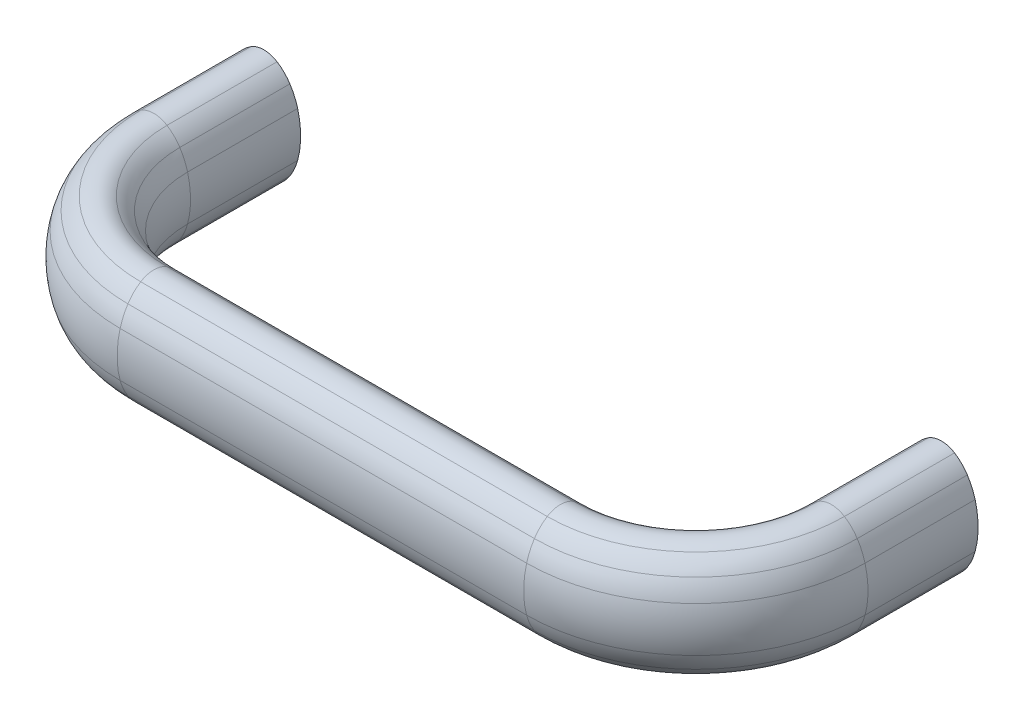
ISO-10303-21;
HEADER;
FILE_DESCRIPTION(('STEP AP214'),'2;1');
FILE_NAME('part.step','',(''),(''),'','','');
FILE_SCHEMA(('AUTOMOTIVE_DESIGN { 1 0 10303 214 1 1 1 1 }'));
ENDSEC;
DATA;
#1=APPLICATION_CONTEXT('core data for automotive mechanical design processes');
#2=APPLICATION_PROTOCOL_DEFINITION('international standard','automotive_design',2000,#1);
#3=PRODUCT_CONTEXT('',#1,'mechanical');
#4=PRODUCT('Part','Part','',(#3));
#5=PRODUCT_RELATED_PRODUCT_CATEGORY('part','',(#4));
#6=PRODUCT_DEFINITION_FORMATION('','',#4);
#7=PRODUCT_DEFINITION_CONTEXT('part definition',#1,'design');
#8=PRODUCT_DEFINITION('design','',#6,#7);
#9=PRODUCT_DEFINITION_SHAPE('','',#8);
#10=(LENGTH_UNIT() NAMED_UNIT(*) SI_UNIT(.MILLI.,.METRE.));
#11=(NAMED_UNIT(*) PLANE_ANGLE_UNIT() SI_UNIT($,.RADIAN.));
#12=(NAMED_UNIT(*) SI_UNIT($,.STERADIAN.) SOLID_ANGLE_UNIT());
#13=UNCERTAINTY_MEASURE_WITH_UNIT(LENGTH_MEASURE(1.E-05),#10,'distance_accuracy_value','');
#14=(GEOMETRIC_REPRESENTATION_CONTEXT(3) GLOBAL_UNCERTAINTY_ASSIGNED_CONTEXT((#13)) GLOBAL_UNIT_ASSIGNED_CONTEXT((#10,
#11,#12)) REPRESENTATION_CONTEXT('',''));
#15=CARTESIAN_POINT('',(0.,0.,0.));
#16=DIRECTION('',(0.,0.,1.));
#17=DIRECTION('',(1.,0.,0.));
#18=AXIS2_PLACEMENT_3D('',#15,#16,#17);
#19=CARTESIAN_POINT('',(118.266980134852,2.95863916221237,19.4999999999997));
#20=DIRECTION('',(0.,0.,-1.));
#21=DIRECTION('',(0.,1.,0.));
#22=AXIS2_PLACEMENT_3D('',#19,#20,#21);
#23=CYLINDRICAL_SURFACE('',#22,7.54594714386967);
#24=CARTESIAN_POINT('',(118.266980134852,2.95863916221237,19.4999999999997));
#25=DIRECTION('',(0.,0.,1.));
#26=DIRECTION('',(0.,1.,0.));
#27=AXIS2_PLACEMENT_3D('',#24,#25,#26);
#28=CIRCLE('',#27,7.54594714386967);
#29=CARTESIAN_POINT('',(124.593831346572,7.07109244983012,19.5));
#30=VERTEX_POINT('',#29);
#31=CARTESIAN_POINT('',(122.322235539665,9.32230335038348,19.5));
#32=VERTEX_POINT('',#31);
#33=EDGE_CURVE('E504',#30,#32,#28,.T.);
#34=ORIENTED_EDGE('',*,*,#33,.F.);
#35=DIRECTION('',(0.,0.,-1.));
#36=VECTOR('',#35,1.);
#37=CARTESIAN_POINT('',(124.593831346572,7.07109244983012,19.5));
#38=LINE('',#37,#36);
#39=CARTESIAN_POINT('',(124.593831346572,7.07109244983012,0.));
#40=VERTEX_POINT('',#39);
#41=EDGE_CURVE('E22',#30,#40,#38,.T.);
#42=ORIENTED_EDGE('',*,*,#41,.T.);
#43=CARTESIAN_POINT('',(118.266980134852,2.95863916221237,0.));
#44=DIRECTION('',(0.,0.,1.));
#45=DIRECTION('',(0.,1.,0.));
#46=AXIS2_PLACEMENT_3D('',#43,#44,#45);
#47=CIRCLE('',#46,7.54594714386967);
#48=CARTESIAN_POINT('',(122.322235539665,9.32230335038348,0.));
#49=VERTEX_POINT('',#48);
#50=EDGE_CURVE('E17',#40,#49,#47,.T.);
#51=ORIENTED_EDGE('',*,*,#50,.T.);
#52=DIRECTION('',(0.,0.,-1.));
#53=VECTOR('',#52,1.);
#54=CARTESIAN_POINT('',(122.322235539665,9.32230335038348,19.5));
#55=LINE('',#54,#53);
#56=EDGE_CURVE('E9',#32,#49,#55,.T.);
#57=ORIENTED_EDGE('',*,*,#56,.F.);
#58=EDGE_LOOP('',(#34,#42,#51,#57));
#59=FACE_BOUND('',#58,.T.);
#60=ADVANCED_FACE('F14',(#59),#23,.T.);
#61=CARTESIAN_POINT('',(115.517667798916,1.17158614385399,19.4999999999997));
#62=DIRECTION('',(0.,0.,-1.));
#63=DIRECTION('',(0.,1.,0.));
#64=AXIS2_PLACEMENT_3D('',#61,#62,#63);
#65=CYLINDRICAL_SURFACE('',#64,10.8250135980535);
#66=CARTESIAN_POINT('',(115.517667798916,1.17158614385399,19.4999999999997));
#67=DIRECTION('',(0.,0.,1.));
#68=DIRECTION('',(0.,1.,0.));
#69=AXIS2_PLACEMENT_3D('',#66,#67,#68);
#70=CIRCLE('',#69,10.8250135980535);
#71=CARTESIAN_POINT('',(125.97045040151,3.98588095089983,19.5));
#72=VERTEX_POINT('',#71);
#73=EDGE_CURVE('E564',#72,#30,#70,.T.);
#74=ORIENTED_EDGE('',*,*,#73,.F.);
#75=DIRECTION('',(0.,0.,-1.));
#76=VECTOR('',#75,1.);
#77=CARTESIAN_POINT('',(125.97045040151,3.98588095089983,19.5));
#78=LINE('',#77,#76);
#79=CARTESIAN_POINT('',(125.97045040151,3.98588095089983,0.));
#80=VERTEX_POINT('',#79);
#81=EDGE_CURVE('E596',#72,#80,#78,.T.);
#82=ORIENTED_EDGE('',*,*,#81,.T.);
#83=CARTESIAN_POINT('',(115.517667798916,1.17158614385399,0.));
#84=DIRECTION('',(0.,0.,1.));
#85=DIRECTION('',(0.,1.,0.));
#86=AXIS2_PLACEMENT_3D('',#83,#84,#85);
#87=CIRCLE('',#86,10.8250135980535);
#88=EDGE_CURVE('E38',#80,#40,#87,.T.);
#89=ORIENTED_EDGE('',*,*,#88,.T.);
#90=ORIENTED_EDGE('',*,*,#41,.F.);
#91=EDGE_LOOP('',(#74,#82,#89,#90));
#92=FACE_BOUND('',#91,.T.);
#93=ADVANCED_FACE('F685',(#92),#65,.T.);
#94=CARTESIAN_POINT('',(111.166283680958,2.46379646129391E-05,19.4999999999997));
#95=DIRECTION('',(0.,0.,-1.));
#96=DIRECTION('',(0.,1.,0.));
#97=AXIS2_PLACEMENT_3D('',#94,#95,#96);
#98=CYLINDRICAL_SURFACE('',#97,15.331353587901);
#99=CARTESIAN_POINT('',(111.166283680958,2.46379646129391E-05,19.4999999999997));
#100=DIRECTION('',(0.,0.,1.));
#101=DIRECTION('',(0.,1.,0.));
#102=AXIS2_PLACEMENT_3D('',#99,#100,#101);
#103=CIRCLE('',#102,15.331353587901);
#104=CARTESIAN_POINT('',(125.97045040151,-3.98583167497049,19.5));
#105=VERTEX_POINT('',#104);
#106=EDGE_CURVE('E562',#105,#72,#103,.T.);
#107=ORIENTED_EDGE('',*,*,#106,.F.);
#108=DIRECTION('',(0.,0.,-1.));
#109=VECTOR('',#108,1.);
#110=CARTESIAN_POINT('',(125.97045040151,-3.98583167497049,19.5));
#111=LINE('',#110,#109);
#112=CARTESIAN_POINT('',(125.97045040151,-3.98583167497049,0.));
#113=VERTEX_POINT('',#112);
#114=EDGE_CURVE('E593',#105,#113,#111,.T.);
#115=ORIENTED_EDGE('',*,*,#114,.T.);
#116=CARTESIAN_POINT('',(111.166283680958,2.46379646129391E-05,0.));
#117=DIRECTION('',(0.,0.,1.));
#118=DIRECTION('',(0.,1.,0.));
#119=AXIS2_PLACEMENT_3D('',#116,#117,#118);
#120=CIRCLE('',#119,15.331353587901);
#121=EDGE_CURVE('E622',#113,#80,#120,.T.);
#122=ORIENTED_EDGE('',*,*,#121,.T.);
#123=ORIENTED_EDGE('',*,*,#81,.F.);
#124=EDGE_LOOP('',(#107,#115,#122,#123));
#125=FACE_BOUND('',#124,.T.);
#126=ADVANCED_FACE('F690',(#125),#98,.T.);
#127=CARTESIAN_POINT('',(115.517667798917,-1.1715368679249,19.4999999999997));
#128=DIRECTION('',(0.,0.,-1.));
#129=DIRECTION('',(0.,1.,0.));
#130=AXIS2_PLACEMENT_3D('',#127,#128,#129);
#131=CYLINDRICAL_SURFACE('',#130,10.8250135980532);
#132=CARTESIAN_POINT('',(115.517667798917,-1.1715368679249,19.4999999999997));
#133=DIRECTION('',(0.,0.,1.));
#134=DIRECTION('',(0.,1.,0.));
#135=AXIS2_PLACEMENT_3D('',#132,#133,#134);
#136=CIRCLE('',#135,10.8250135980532);
#137=CARTESIAN_POINT('',(124.593831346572,-7.07104317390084,19.5));
#138=VERTEX_POINT('',#137);
#139=EDGE_CURVE('E559',#138,#105,#136,.T.);
#140=ORIENTED_EDGE('',*,*,#139,.F.);
#141=DIRECTION('',(0.,0.,-1.));
#142=VECTOR('',#141,1.);
#143=CARTESIAN_POINT('',(124.593831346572,-7.07104317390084,19.5));
#144=LINE('',#143,#142);
#145=CARTESIAN_POINT('',(124.593831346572,-7.07104317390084,0.));
#146=VERTEX_POINT('',#145);
#147=EDGE_CURVE('E590',#138,#146,#144,.T.);
#148=ORIENTED_EDGE('',*,*,#147,.T.);
#149=CARTESIAN_POINT('',(115.517667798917,-1.1715368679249,0.));
#150=DIRECTION('',(0.,0.,1.));
#151=DIRECTION('',(0.,1.,0.));
#152=AXIS2_PLACEMENT_3D('',#149,#150,#151);
#153=CIRCLE('',#152,10.8250135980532);
#154=EDGE_CURVE('E620',#146,#113,#153,.T.);
#155=ORIENTED_EDGE('',*,*,#154,.T.);
#156=ORIENTED_EDGE('',*,*,#114,.F.);
#157=EDGE_LOOP('',(#140,#148,#155,#156));
#158=FACE_BOUND('',#157,.T.);
#159=ADVANCED_FACE('F695',(#158),#131,.T.);
#160=CARTESIAN_POINT('',(118.266980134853,-2.95858988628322,19.4999999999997));
#161=DIRECTION('',(0.,0.,-1.));
#162=DIRECTION('',(0.,1.,0.));
#163=AXIS2_PLACEMENT_3D('',#160,#161,#162);
#164=CYLINDRICAL_SURFACE('',#163,7.54594714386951);
#165=CARTESIAN_POINT('',(118.266980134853,-2.95858988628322,19.4999999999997));
#166=DIRECTION('',(0.,0.,1.));
#167=DIRECTION('',(0.,1.,0.));
#168=AXIS2_PLACEMENT_3D('',#165,#166,#167);
#169=CIRCLE('',#168,7.54594714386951);
#170=CARTESIAN_POINT('',(122.322235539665,-9.32225407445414,19.5));
#171=VERTEX_POINT('',#170);
#172=EDGE_CURVE('E556',#171,#138,#169,.T.);
#173=ORIENTED_EDGE('',*,*,#172,.F.);
#174=DIRECTION('',(0.,0.,-1.));
#175=VECTOR('',#174,1.);
#176=CARTESIAN_POINT('',(122.322235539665,-9.32225407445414,19.5));
#177=LINE('',#176,#175);
#178=CARTESIAN_POINT('',(122.322235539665,-9.32225407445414,0.));
#179=VERTEX_POINT('',#178);
#180=EDGE_CURVE('E587',#171,#179,#177,.T.);
#181=ORIENTED_EDGE('',*,*,#180,.T.);
#182=CARTESIAN_POINT('',(118.266980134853,-2.95858988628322,0.));
#183=DIRECTION('',(0.,0.,1.));
#184=DIRECTION('',(0.,1.,0.));
#185=AXIS2_PLACEMENT_3D('',#182,#183,#184);
#186=CIRCLE('',#185,7.54594714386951);
#187=EDGE_CURVE('E618',#179,#146,#186,.T.);
#188=ORIENTED_EDGE('',*,*,#187,.T.);
#189=ORIENTED_EDGE('',*,*,#147,.F.);
#190=EDGE_LOOP('',(#173,#181,#188,#189));
#191=FACE_BOUND('',#190,.T.);
#192=ADVANCED_FACE('F701',(#191),#164,.T.);
#193=CARTESIAN_POINT('',(119.997637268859,-5.67440423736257,19.4999999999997));
#194=DIRECTION('',(0.,0.,-1.));
#195=DIRECTION('',(0.,1.,0.));
#196=AXIS2_PLACEMENT_3D('',#193,#194,#195);
#197=CYLINDRICAL_SURFACE('',#196,4.3255711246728);
#198=CARTESIAN_POINT('',(119.997637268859,-5.67440423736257,19.4999999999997));
#199=DIRECTION('',(0.,0.,-1.));
#200=DIRECTION('',(0.,-1.,0.));
#201=AXIS2_PLACEMENT_3D('',#198,#199,#200);
#202=CIRCLE('',#201,4.3255711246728);
#203=CARTESIAN_POINT('',(117.673038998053,-9.32225407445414,19.4999999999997));
#204=VERTEX_POINT('',#203);
#205=EDGE_CURVE('E553',#171,#204,#202,.T.);
#206=ORIENTED_EDGE('',*,*,#205,.T.);
#207=DIRECTION('',(0.,0.,-1.));
#208=VECTOR('',#207,1.);
#209=CARTESIAN_POINT('',(117.673038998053,-9.32225407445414,19.4999999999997));
#210=LINE('',#209,#208);
#211=CARTESIAN_POINT('',(117.673038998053,-9.32225407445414,0.));
#212=VERTEX_POINT('',#211);
#213=EDGE_CURVE('E584',#204,#212,#210,.T.);
#214=ORIENTED_EDGE('',*,*,#213,.T.);
#215=CARTESIAN_POINT('',(119.997637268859,-5.67440423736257,0.));
#216=DIRECTION('',(0.,0.,-1.));
#217=DIRECTION('',(0.,-1.,0.));
#218=AXIS2_PLACEMENT_3D('',#215,#216,#217);
#219=CIRCLE('',#218,4.3255711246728);
#220=EDGE_CURVE('E615',#179,#212,#219,.T.);
#221=ORIENTED_EDGE('',*,*,#220,.F.);
#222=ORIENTED_EDGE('',*,*,#180,.F.);
#223=EDGE_LOOP('',(#206,#214,#221,#222));
#224=FACE_BOUND('',#223,.T.);
#225=ADVANCED_FACE('F705',(#224),#197,.T.);
#226=CARTESIAN_POINT('',(121.728294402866,-2.95858988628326,19.5));
#227=DIRECTION('',(0.,0.,-1.));
#228=DIRECTION('',(0.,1.,0.));
#229=AXIS2_PLACEMENT_3D('',#226,#227,#228);
#230=CYLINDRICAL_SURFACE('',#229,7.54594714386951);
#231=CARTESIAN_POINT('',(121.728294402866,-2.95858988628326,19.5));
#232=DIRECTION('',(0.,0.,-1.));
#233=DIRECTION('',(0.,-1.,0.));
#234=AXIS2_PLACEMENT_3D('',#231,#232,#233);
#235=CIRCLE('',#234,7.54594714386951);
#236=CARTESIAN_POINT('',(115.401443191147,-7.07104317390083,19.4999999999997));
#237=VERTEX_POINT('',#236);
#238=EDGE_CURVE('E550',#204,#237,#235,.T.);
#239=ORIENTED_EDGE('',*,*,#238,.T.);
#240=DIRECTION('',(0.,0.,-1.));
#241=VECTOR('',#240,1.);
#242=CARTESIAN_POINT('',(115.401443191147,-7.07104317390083,19.4999999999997));
#243=LINE('',#242,#241);
#244=CARTESIAN_POINT('',(115.401443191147,-7.07104317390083,0.));
#245=VERTEX_POINT('',#244);
#246=EDGE_CURVE('E581',#237,#245,#243,.T.);
#247=ORIENTED_EDGE('',*,*,#246,.T.);
#248=CARTESIAN_POINT('',(121.728294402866,-2.95858988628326,0.));
#249=DIRECTION('',(0.,0.,-1.));
#250=DIRECTION('',(0.,-1.,0.));
#251=AXIS2_PLACEMENT_3D('',#248,#249,#250);
#252=CIRCLE('',#251,7.54594714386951);
#253=EDGE_CURVE('E612',#212,#245,#252,.T.);
#254=ORIENTED_EDGE('',*,*,#253,.F.);
#255=ORIENTED_EDGE('',*,*,#213,.F.);
#256=EDGE_LOOP('',(#239,#247,#254,#255));
#257=FACE_BOUND('',#256,.T.);
#258=ADVANCED_FACE('F709',(#257),#230,.T.);
#259=CARTESIAN_POINT('',(124.477606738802,-1.17153686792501,19.5));
#260=DIRECTION('',(0.,0.,-1.));
#261=DIRECTION('',(0.,1.,0.));
#262=AXIS2_PLACEMENT_3D('',#259,#260,#261);
#263=CYLINDRICAL_SURFACE('',#262,10.8250135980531);
#264=CARTESIAN_POINT('',(124.477606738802,-1.17153686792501,19.5));
#265=DIRECTION('',(0.,0.,-1.));
#266=DIRECTION('',(0.,-1.,0.));
#267=AXIS2_PLACEMENT_3D('',#264,#265,#266);
#268=CIRCLE('',#267,10.8250135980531);
#269=CARTESIAN_POINT('',(114.024824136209,-3.98583167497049,19.4999999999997));
#270=VERTEX_POINT('',#269);
#271=EDGE_CURVE('E547',#237,#270,#268,.T.);
#272=ORIENTED_EDGE('',*,*,#271,.T.);
#273=DIRECTION('',(0.,0.,-1.));
#274=VECTOR('',#273,1.);
#275=CARTESIAN_POINT('',(114.024824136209,-3.98583167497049,19.4999999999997));
#276=LINE('',#275,#274);
#277=CARTESIAN_POINT('',(114.024824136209,-3.98583167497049,0.));
#278=VERTEX_POINT('',#277);
#279=EDGE_CURVE('E578',#270,#278,#276,.T.);
#280=ORIENTED_EDGE('',*,*,#279,.T.);
#281=CARTESIAN_POINT('',(124.477606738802,-1.17153686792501,0.));
#282=DIRECTION('',(0.,0.,-1.));
#283=DIRECTION('',(0.,-1.,0.));
#284=AXIS2_PLACEMENT_3D('',#281,#282,#283);
#285=CIRCLE('',#284,10.8250135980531);
#286=EDGE_CURVE('E609',#245,#278,#285,.T.);
#287=ORIENTED_EDGE('',*,*,#286,.F.);
#288=ORIENTED_EDGE('',*,*,#246,.F.);
#289=EDGE_LOOP('',(#272,#280,#287,#288));
#290=FACE_BOUND('',#289,.T.);
#291=ADVANCED_FACE('F713',(#290),#263,.T.);
#292=CARTESIAN_POINT('',(128.82899085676,2.46379646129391E-05,19.5));
#293=DIRECTION('',(0.,0.,-1.));
#294=DIRECTION('',(0.,1.,0.));
#295=AXIS2_PLACEMENT_3D('',#292,#293,#294);
#296=CYLINDRICAL_SURFACE('',#295,15.331353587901);
#297=CARTESIAN_POINT('',(128.82899085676,2.46379646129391E-05,19.5));
#298=DIRECTION('',(0.,0.,-1.));
#299=DIRECTION('',(0.,-1.,0.));
#300=AXIS2_PLACEMENT_3D('',#297,#298,#299);
#301=CIRCLE('',#300,15.331353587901);
#302=CARTESIAN_POINT('',(114.024824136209,3.98588095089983,19.4999999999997));
#303=VERTEX_POINT('',#302);
#304=EDGE_CURVE('E544',#270,#303,#301,.T.);
#305=ORIENTED_EDGE('',*,*,#304,.T.);
#306=DIRECTION('',(0.,0.,-1.));
#307=VECTOR('',#306,1.);
#308=CARTESIAN_POINT('',(114.024824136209,3.98588095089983,19.4999999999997));
#309=LINE('',#308,#307);
#310=CARTESIAN_POINT('',(114.024824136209,3.98588095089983,0.));
#311=VERTEX_POINT('',#310);
#312=EDGE_CURVE('E575',#303,#311,#309,.T.);
#313=ORIENTED_EDGE('',*,*,#312,.T.);
#314=CARTESIAN_POINT('',(128.82899085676,2.46379646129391E-05,0.));
#315=DIRECTION('',(0.,0.,-1.));
#316=DIRECTION('',(0.,-1.,0.));
#317=AXIS2_PLACEMENT_3D('',#314,#315,#316);
#318=CIRCLE('',#317,15.331353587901);
#319=EDGE_CURVE('E606',#278,#311,#318,.T.);
#320=ORIENTED_EDGE('',*,*,#319,.F.);
#321=ORIENTED_EDGE('',*,*,#279,.F.);
#322=EDGE_LOOP('',(#305,#313,#320,#321));
#323=FACE_BOUND('',#322,.T.);
#324=ADVANCED_FACE('F717',(#323),#296,.T.);
#325=CARTESIAN_POINT('',(124.477606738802,1.1715861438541,19.5));
#326=DIRECTION('',(0.,0.,-1.));
#327=DIRECTION('',(0.,1.,0.));
#328=AXIS2_PLACEMENT_3D('',#325,#326,#327);
#329=CYLINDRICAL_SURFACE('',#328,10.8250135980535);
#330=CARTESIAN_POINT('',(124.477606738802,1.1715861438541,19.5));
#331=DIRECTION('',(0.,0.,-1.));
#332=DIRECTION('',(0.,-1.,0.));
#333=AXIS2_PLACEMENT_3D('',#330,#331,#332);
#334=CIRCLE('',#333,10.8250135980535);
#335=CARTESIAN_POINT('',(115.401443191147,7.07109244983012,19.4999999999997));
#336=VERTEX_POINT('',#335);
#337=EDGE_CURVE('E541',#303,#336,#334,.T.);
#338=ORIENTED_EDGE('',*,*,#337,.T.);
#339=DIRECTION('',(0.,0.,-1.));
#340=VECTOR('',#339,1.);
#341=CARTESIAN_POINT('',(115.401443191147,7.07109244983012,19.4999999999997));
#342=LINE('',#341,#340);
#343=CARTESIAN_POINT('',(115.401443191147,7.07109244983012,0.));
#344=VERTEX_POINT('',#343);
#345=EDGE_CURVE('E572',#336,#344,#342,.T.);
#346=ORIENTED_EDGE('',*,*,#345,.T.);
#347=CARTESIAN_POINT('',(124.477606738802,1.1715861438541,0.));
#348=DIRECTION('',(0.,0.,-1.));
#349=DIRECTION('',(0.,-1.,0.));
#350=AXIS2_PLACEMENT_3D('',#347,#348,#349);
#351=CIRCLE('',#350,10.8250135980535);
#352=EDGE_CURVE('E603',#311,#344,#351,.T.);
#353=ORIENTED_EDGE('',*,*,#352,.F.);
#354=ORIENTED_EDGE('',*,*,#312,.F.);
#355=EDGE_LOOP('',(#338,#346,#353,#354));
#356=FACE_BOUND('',#355,.T.);
#357=ADVANCED_FACE('F721',(#356),#329,.T.);
#358=CARTESIAN_POINT('',(121.728294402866,2.95863916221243,19.5));
#359=DIRECTION('',(0.,0.,-1.));
#360=DIRECTION('',(0.,1.,0.));
#361=AXIS2_PLACEMENT_3D('',#358,#359,#360);
#362=CYLINDRICAL_SURFACE('',#361,7.54594714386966);
#363=CARTESIAN_POINT('',(121.728294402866,2.95863916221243,19.5));
#364=DIRECTION('',(0.,0.,-1.));
#365=DIRECTION('',(0.,-1.,0.));
#366=AXIS2_PLACEMENT_3D('',#363,#364,#365);
#367=CIRCLE('',#366,7.54594714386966);
#368=CARTESIAN_POINT('',(117.673038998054,9.32230335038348,19.4999999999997));
#369=VERTEX_POINT('',#368);
#370=EDGE_CURVE('E538',#336,#369,#367,.T.);
#371=ORIENTED_EDGE('',*,*,#370,.T.);
#372=DIRECTION('',(0.,0.,-1.));
#373=VECTOR('',#372,1.);
#374=CARTESIAN_POINT('',(117.673038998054,9.32230335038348,19.4999999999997));
#375=LINE('',#374,#373);
#376=CARTESIAN_POINT('',(117.673038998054,9.32230335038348,0.));
#377=VERTEX_POINT('',#376);
#378=EDGE_CURVE('E569',#369,#377,#375,.T.);
#379=ORIENTED_EDGE('',*,*,#378,.T.);
#380=CARTESIAN_POINT('',(121.728294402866,2.95863916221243,0.));
#381=DIRECTION('',(0.,0.,-1.));
#382=DIRECTION('',(0.,-1.,0.));
#383=AXIS2_PLACEMENT_3D('',#380,#381,#382);
#384=CIRCLE('',#383,7.54594714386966);
#385=EDGE_CURVE('E601',#344,#377,#384,.T.);
#386=ORIENTED_EDGE('',*,*,#385,.F.);
#387=ORIENTED_EDGE('',*,*,#345,.F.);
#388=EDGE_LOOP('',(#371,#379,#386,#387));
#389=FACE_BOUND('',#388,.T.);
#390=ADVANCED_FACE('F682',(#389),#362,.T.);
#391=CARTESIAN_POINT('',(119.997637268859,5.67445351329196,19.4999999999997));
#392=DIRECTION('',(0.,0.,-1.));
#393=DIRECTION('',(0.,1.,0.));
#394=AXIS2_PLACEMENT_3D('',#391,#392,#393);
#395=CYLINDRICAL_SURFACE('',#394,4.32557112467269);
#396=CARTESIAN_POINT('',(119.997637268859,5.67445351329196,19.4999999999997));
#397=DIRECTION('',(0.,0.,-1.));
#398=DIRECTION('',(0.,-1.,0.));
#399=AXIS2_PLACEMENT_3D('',#396,#397,#398);
#400=CIRCLE('',#399,4.32557112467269);
#401=EDGE_CURVE('E467',#369,#32,#400,.T.);
#402=ORIENTED_EDGE('',*,*,#401,.T.);
#403=ORIENTED_EDGE('',*,*,#56,.T.);
#404=CARTESIAN_POINT('',(119.997637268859,5.67445351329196,0.));
#405=DIRECTION('',(0.,0.,-1.));
#406=DIRECTION('',(0.,-1.,0.));
#407=AXIS2_PLACEMENT_3D('',#404,#405,#406);
#408=CIRCLE('',#407,4.32557112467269);
#409=EDGE_CURVE('E30',#377,#49,#408,.T.);
#410=ORIENTED_EDGE('',*,*,#409,.F.);
#411=ORIENTED_EDGE('',*,*,#378,.F.);
#412=EDGE_LOOP('',(#402,#403,#410,#411));
#413=FACE_BOUND('',#412,.T.);
#414=ADVANCED_FACE('F627',(#413),#395,.T.);
#415=CARTESIAN_POINT('',(96.,2.95863916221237,19.5));
#416=DIRECTION('',(0.,1.,0.));
#417=DIRECTION('',(-1.,0.,0.));
#418=AXIS2_PLACEMENT_3D('',#415,#416,#417);
#419=TOROIDAL_SURFACE('',#418,22.2669801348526,7.54594714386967);
#420=CARTESIAN_POINT('',(96.,2.95863916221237,41.7669801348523));
#421=DIRECTION('',(-1.,0.,0.));
#422=DIRECTION('',(0.,1.,0.));
#423=AXIS2_PLACEMENT_3D('',#420,#421,#422);
#424=CIRCLE('',#423,7.54594714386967);
#425=CARTESIAN_POINT('',(96.,7.07109244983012,48.0938313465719));
#426=VERTEX_POINT('',#425);
#427=CARTESIAN_POINT('',(96.,9.32230335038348,45.8222355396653));
#428=VERTEX_POINT('',#427);
#429=EDGE_CURVE('E434',#426,#428,#424,.T.);
#430=ORIENTED_EDGE('',*,*,#429,.F.);
#431=CARTESIAN_POINT('',(96.,7.07109244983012,19.5));
#432=DIRECTION('',(0.,1.,0.));
#433=DIRECTION('',(-1.,0.,0.));
#434=AXIS2_PLACEMENT_3D('',#431,#432,#433);
#435=CIRCLE('',#434,28.5938313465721);
#436=EDGE_CURVE('E531',#426,#30,#435,.T.);
#437=ORIENTED_EDGE('',*,*,#436,.T.);
#438=ORIENTED_EDGE('',*,*,#33,.T.);
#439=CARTESIAN_POINT('',(96.,9.32230335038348,19.5));
#440=DIRECTION('',(0.,1.,0.));
#441=DIRECTION('',(-1.,0.,0.));
#442=AXIS2_PLACEMENT_3D('',#439,#440,#441);
#443=CIRCLE('',#442,26.3222355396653);
#444=EDGE_CURVE('E534',#428,#32,#443,.T.);
#445=ORIENTED_EDGE('',*,*,#444,.F.);
#446=EDGE_LOOP('',(#430,#437,#438,#445));
#447=FACE_BOUND('',#446,.T.);
#448=ADVANCED_FACE('F671',(#447),#419,.T.);
#449=CARTESIAN_POINT('',(96.,1.17158614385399,19.5));
#450=DIRECTION('',(0.,1.,0.));
#451=DIRECTION('',(-1.,0.,0.));
#452=AXIS2_PLACEMENT_3D('',#449,#450,#451);
#453=TOROIDAL_SURFACE('',#452,19.5176677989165,10.8250135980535);
#454=CARTESIAN_POINT('',(96.,1.17158614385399,39.0176677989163));
#455=DIRECTION('',(-1.,0.,0.));
#456=DIRECTION('',(0.,1.,0.));
#457=AXIS2_PLACEMENT_3D('',#454,#455,#456);
#458=CIRCLE('',#457,10.8250135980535);
#459=CARTESIAN_POINT('',(96.,3.98588095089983,49.4704504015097));
#460=VERTEX_POINT('',#459);
#461=EDGE_CURVE('E495',#460,#426,#458,.T.);
#462=ORIENTED_EDGE('',*,*,#461,.F.);
#463=CARTESIAN_POINT('',(96.,3.98588095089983,19.5));
#464=DIRECTION('',(0.,1.,0.));
#465=DIRECTION('',(-1.,0.,0.));
#466=AXIS2_PLACEMENT_3D('',#463,#464,#465);
#467=CIRCLE('',#466,29.9704504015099);
#468=EDGE_CURVE('E528',#460,#72,#467,.T.);
#469=ORIENTED_EDGE('',*,*,#468,.T.);
#470=ORIENTED_EDGE('',*,*,#73,.T.);
#471=ORIENTED_EDGE('',*,*,#436,.F.);
#472=EDGE_LOOP('',(#462,#469,#470,#471));
#473=FACE_BOUND('',#472,.T.);
#474=ADVANCED_FACE('F666',(#473),#453,.T.);
#475=CARTESIAN_POINT('',(96.,2.46379646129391E-05,19.5));
#476=DIRECTION('',(0.,1.,0.));
#477=DIRECTION('',(-1.,0.,0.));
#478=AXIS2_PLACEMENT_3D('',#475,#476,#477);
#479=DEGENERATE_TOROIDAL_SURFACE('',#478,15.1662836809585,15.331353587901,.T.);
#480=CARTESIAN_POINT('',(96.,2.46379646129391E-05,34.6662836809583));
#481=DIRECTION('',(-1.,0.,0.));
#482=DIRECTION('',(0.,1.,0.));
#483=AXIS2_PLACEMENT_3D('',#480,#481,#482);
#484=CIRCLE('',#483,15.331353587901);
#485=CARTESIAN_POINT('',(96.,-3.98583167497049,49.4704504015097));
#486=VERTEX_POINT('',#485);
#487=EDGE_CURVE('E493',#486,#460,#484,.T.);
#488=ORIENTED_EDGE('',*,*,#487,.F.);
#489=CARTESIAN_POINT('',(96.,-3.98583167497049,19.5));
#490=DIRECTION('',(0.,1.,0.));
#491=DIRECTION('',(-1.,0.,0.));
#492=AXIS2_PLACEMENT_3D('',#489,#490,#491);
#493=CIRCLE('',#492,29.9704504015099);
#494=EDGE_CURVE('E525',#486,#105,#493,.T.);
#495=ORIENTED_EDGE('',*,*,#494,.T.);
#496=ORIENTED_EDGE('',*,*,#106,.T.);
#497=ORIENTED_EDGE('',*,*,#468,.F.);
#498=EDGE_LOOP('',(#488,#495,#496,#497));
#499=FACE_BOUND('',#498,.T.);
#500=ADVANCED_FACE('F680',(#499),#479,.T.);
#501=CARTESIAN_POINT('',(96.,-1.1715368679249,19.5));
#502=DIRECTION('',(0.,1.,0.));
#503=DIRECTION('',(-1.,0.,0.));
#504=AXIS2_PLACEMENT_3D('',#501,#502,#503);
#505=TOROIDAL_SURFACE('',#504,19.5176677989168,10.8250135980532);
#506=CARTESIAN_POINT('',(96.,-1.1715368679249,39.0176677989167));
#507=DIRECTION('',(-1.,0.,0.));
#508=DIRECTION('',(0.,1.,0.));
#509=AXIS2_PLACEMENT_3D('',#506,#507,#508);
#510=CIRCLE('',#509,10.8250135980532);
#511=CARTESIAN_POINT('',(96.,-7.07104317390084,48.0938313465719));
#512=VERTEX_POINT('',#511);
#513=EDGE_CURVE('E490',#512,#486,#510,.T.);
#514=ORIENTED_EDGE('',*,*,#513,.F.);
#515=CARTESIAN_POINT('',(96.,-7.07104317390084,19.5));
#516=DIRECTION('',(0.,1.,0.));
#517=DIRECTION('',(-1.,0.,0.));
#518=AXIS2_PLACEMENT_3D('',#515,#516,#517);
#519=CIRCLE('',#518,28.5938313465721);
#520=EDGE_CURVE('E522',#512,#138,#519,.T.);
#521=ORIENTED_EDGE('',*,*,#520,.T.);
#522=ORIENTED_EDGE('',*,*,#139,.T.);
#523=ORIENTED_EDGE('',*,*,#494,.F.);
#524=EDGE_LOOP('',(#514,#521,#522,#523));
#525=FACE_BOUND('',#524,.T.);
#526=ADVANCED_FACE('F898',(#525),#505,.T.);
#527=CARTESIAN_POINT('',(96.,-2.95858988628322,19.5));
#528=DIRECTION('',(0.,1.,0.));
#529=DIRECTION('',(-1.,0.,0.));
#530=AXIS2_PLACEMENT_3D('',#527,#528,#529);
#531=TOROIDAL_SURFACE('',#530,22.2669801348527,7.54594714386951);
#532=CARTESIAN_POINT('',(96.,-2.95858988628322,41.7669801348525));
#533=DIRECTION('',(-1.,0.,0.));
#534=DIRECTION('',(0.,1.,0.));
#535=AXIS2_PLACEMENT_3D('',#532,#533,#534);
#536=CIRCLE('',#535,7.54594714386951);
#537=CARTESIAN_POINT('',(96.,-9.32225407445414,45.8222355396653));
#538=VERTEX_POINT('',#537);
#539=EDGE_CURVE('E487',#538,#512,#536,.T.);
#540=ORIENTED_EDGE('',*,*,#539,.F.);
#541=CARTESIAN_POINT('',(96.,-9.32225407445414,19.5));
#542=DIRECTION('',(0.,1.,0.));
#543=DIRECTION('',(-1.,0.,0.));
#544=AXIS2_PLACEMENT_3D('',#541,#542,#543);
#545=CIRCLE('',#544,26.3222355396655);
#546=EDGE_CURVE('E519',#538,#171,#545,.T.);
#547=ORIENTED_EDGE('',*,*,#546,.T.);
#548=ORIENTED_EDGE('',*,*,#172,.T.);
#549=ORIENTED_EDGE('',*,*,#520,.F.);
#550=EDGE_LOOP('',(#540,#547,#548,#549));
#551=FACE_BOUND('',#550,.T.);
#552=ADVANCED_FACE('F894',(#551),#531,.T.);
#553=CARTESIAN_POINT('',(96.,-5.67440423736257,19.5));
#554=DIRECTION('',(0.,1.,0.));
#555=DIRECTION('',(-1.,0.,0.));
#556=AXIS2_PLACEMENT_3D('',#553,#554,#555);
#557=TOROIDAL_SURFACE('',#556,23.9976372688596,4.3255711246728);
#558=CARTESIAN_POINT('',(96.,-5.67440423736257,43.4976372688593));
#559=DIRECTION('',(1.,0.,0.));
#560=DIRECTION('',(0.,-1.,0.));
#561=AXIS2_PLACEMENT_3D('',#558,#559,#560);
#562=CIRCLE('',#561,4.3255711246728);
#563=CARTESIAN_POINT('',(96.,-9.32225407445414,41.1730389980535));
#564=VERTEX_POINT('',#563);
#565=EDGE_CURVE('E484',#538,#564,#562,.T.);
#566=ORIENTED_EDGE('',*,*,#565,.T.);
#567=CARTESIAN_POINT('',(96.,-9.32225407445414,19.5));
#568=DIRECTION('',(0.,1.,0.));
#569=DIRECTION('',(-1.,0.,0.));
#570=AXIS2_PLACEMENT_3D('',#567,#568,#569);
#571=CIRCLE('',#570,21.6730389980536);
#572=EDGE_CURVE('E516',#564,#204,#571,.T.);
#573=ORIENTED_EDGE('',*,*,#572,.T.);
#574=ORIENTED_EDGE('',*,*,#205,.F.);
#575=ORIENTED_EDGE('',*,*,#546,.F.);
#576=EDGE_LOOP('',(#566,#573,#574,#575));
#577=FACE_BOUND('',#576,.T.);
#578=ADVANCED_FACE('F890',(#577),#557,.T.);
#579=CARTESIAN_POINT('',(96.,-2.95858988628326,19.5));
#580=DIRECTION('',(0.,1.,0.));
#581=DIRECTION('',(-1.,0.,0.));
#582=AXIS2_PLACEMENT_3D('',#579,#580,#581);
#583=TOROIDAL_SURFACE('',#582,25.7282944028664,7.54594714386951);
#584=CARTESIAN_POINT('',(96.,-2.95858988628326,45.2282944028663));
#585=DIRECTION('',(1.,0.,0.));
#586=DIRECTION('',(0.,-1.,0.));
#587=AXIS2_PLACEMENT_3D('',#584,#585,#586);
#588=CIRCLE('',#587,7.54594714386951);
#589=CARTESIAN_POINT('',(96.,-7.07104317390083,38.9014431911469));
#590=VERTEX_POINT('',#589);
#591=EDGE_CURVE('E481',#564,#590,#588,.T.);
#592=ORIENTED_EDGE('',*,*,#591,.T.);
#593=CARTESIAN_POINT('',(96.,-7.07104317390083,19.5));
#594=DIRECTION('',(0.,1.,0.));
#595=DIRECTION('',(-1.,0.,0.));
#596=AXIS2_PLACEMENT_3D('',#593,#594,#595);
#597=CIRCLE('',#596,19.401443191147);
#598=EDGE_CURVE('E513',#590,#237,#597,.T.);
#599=ORIENTED_EDGE('',*,*,#598,.T.);
#600=ORIENTED_EDGE('',*,*,#238,.F.);
#601=ORIENTED_EDGE('',*,*,#572,.F.);
#602=EDGE_LOOP('',(#592,#599,#600,#601));
#603=FACE_BOUND('',#602,.T.);
#604=ADVANCED_FACE('F886',(#603),#583,.T.);
#605=CARTESIAN_POINT('',(96.,-1.17153686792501,19.5));
#606=DIRECTION('',(0.,1.,0.));
#607=DIRECTION('',(-1.,0.,0.));
#608=AXIS2_PLACEMENT_3D('',#605,#606,#607);
#609=TOROIDAL_SURFACE('',#608,28.4776067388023,10.8250135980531);
#610=CARTESIAN_POINT('',(96.,-1.17153686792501,47.9776067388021));
#611=DIRECTION('',(1.,0.,0.));
#612=DIRECTION('',(0.,-1.,0.));
#613=AXIS2_PLACEMENT_3D('',#610,#611,#612);
#614=CIRCLE('',#613,10.8250135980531);
#615=CARTESIAN_POINT('',(96.,-3.98583167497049,37.5248241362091));
#616=VERTEX_POINT('',#615);
#617=EDGE_CURVE('E478',#590,#616,#614,.T.);
#618=ORIENTED_EDGE('',*,*,#617,.T.);
#619=CARTESIAN_POINT('',(96.,-3.98583167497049,19.5));
#620=DIRECTION('',(0.,1.,0.));
#621=DIRECTION('',(-1.,0.,0.));
#622=AXIS2_PLACEMENT_3D('',#619,#620,#621);
#623=CIRCLE('',#622,18.0248241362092);
#624=EDGE_CURVE('E510',#616,#270,#623,.T.);
#625=ORIENTED_EDGE('',*,*,#624,.T.);
#626=ORIENTED_EDGE('',*,*,#271,.F.);
#627=ORIENTED_EDGE('',*,*,#598,.F.);
#628=EDGE_LOOP('',(#618,#625,#626,#627));
#629=FACE_BOUND('',#628,.T.);
#630=ADVANCED_FACE('F883',(#629),#609,.T.);
#631=CARTESIAN_POINT('',(96.,2.46379646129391E-05,19.5));
#632=DIRECTION('',(0.,1.,0.));
#633=DIRECTION('',(-1.,0.,0.));
#634=AXIS2_PLACEMENT_3D('',#631,#632,#633);
#635=TOROIDAL_SURFACE('',#634,32.8289908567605,15.331353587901);
#636=CARTESIAN_POINT('',(96.,2.46379646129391E-05,52.3289908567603));
#637=DIRECTION('',(1.,0.,0.));
#638=DIRECTION('',(0.,-1.,0.));
#639=AXIS2_PLACEMENT_3D('',#636,#637,#638);
#640=CIRCLE('',#639,15.331353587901);
#641=CARTESIAN_POINT('',(96.,3.98588095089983,37.5248241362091));
#642=VERTEX_POINT('',#641);
#643=EDGE_CURVE('E475',#616,#642,#640,.T.);
#644=ORIENTED_EDGE('',*,*,#643,.T.);
#645=CARTESIAN_POINT('',(96.,3.98588095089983,19.5));
#646=DIRECTION('',(0.,1.,0.));
#647=DIRECTION('',(-1.,0.,0.));
#648=AXIS2_PLACEMENT_3D('',#645,#646,#647);
#649=CIRCLE('',#648,18.0248241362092);
#650=EDGE_CURVE('E507',#642,#303,#649,.T.);
#651=ORIENTED_EDGE('',*,*,#650,.T.);
#652=ORIENTED_EDGE('',*,*,#304,.F.);
#653=ORIENTED_EDGE('',*,*,#624,.F.);
#654=EDGE_LOOP('',(#644,#651,#652,#653));
#655=FACE_BOUND('',#654,.T.);
#656=ADVANCED_FACE('F735',(#655),#635,.T.);
#657=CARTESIAN_POINT('',(96.,1.1715861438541,19.5));
#658=DIRECTION('',(0.,1.,0.));
#659=DIRECTION('',(-1.,0.,0.));
#660=AXIS2_PLACEMENT_3D('',#657,#658,#659);
#661=TOROIDAL_SURFACE('',#660,28.4776067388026,10.8250135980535);
#662=CARTESIAN_POINT('',(96.,1.1715861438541,47.9776067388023));
#663=DIRECTION('',(1.,0.,0.));
#664=DIRECTION('',(0.,-1.,0.));
#665=AXIS2_PLACEMENT_3D('',#662,#663,#664);
#666=CIRCLE('',#665,10.8250135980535);
#667=CARTESIAN_POINT('',(96.,7.07109244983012,38.9014431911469));
#668=VERTEX_POINT('',#667);
#669=EDGE_CURVE('E472',#642,#668,#666,.T.);
#670=ORIENTED_EDGE('',*,*,#669,.T.);
#671=CARTESIAN_POINT('',(96.,7.07109244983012,19.5));
#672=DIRECTION('',(0.,1.,0.));
#673=DIRECTION('',(-1.,0.,0.));
#674=AXIS2_PLACEMENT_3D('',#671,#672,#673);
#675=CIRCLE('',#674,19.401443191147);
#676=EDGE_CURVE('E503',#668,#336,#675,.T.);
#677=ORIENTED_EDGE('',*,*,#676,.T.);
#678=ORIENTED_EDGE('',*,*,#337,.F.);
#679=ORIENTED_EDGE('',*,*,#650,.F.);
#680=EDGE_LOOP('',(#670,#677,#678,#679));
#681=FACE_BOUND('',#680,.T.);
#682=ADVANCED_FACE('F733',(#681),#661,.T.);
#683=CARTESIAN_POINT('',(96.,2.95863916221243,19.5));
#684=DIRECTION('',(0.,1.,0.));
#685=DIRECTION('',(-1.,0.,0.));
#686=AXIS2_PLACEMENT_3D('',#683,#684,#685);
#687=TOROIDAL_SURFACE('',#686,25.7282944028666,7.54594714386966);
#688=CARTESIAN_POINT('',(96.,2.95863916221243,45.2282944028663));
#689=DIRECTION('',(1.,0.,0.));
#690=DIRECTION('',(0.,-1.,0.));
#691=AXIS2_PLACEMENT_3D('',#688,#689,#690);
#692=CIRCLE('',#691,7.54594714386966);
#693=CARTESIAN_POINT('',(96.,9.32230335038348,41.1730389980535));
#694=VERTEX_POINT('',#693);
#695=EDGE_CURVE('E469',#668,#694,#692,.T.);
#696=ORIENTED_EDGE('',*,*,#695,.T.);
#697=CARTESIAN_POINT('',(96.,9.32230335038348,19.5));
#698=DIRECTION('',(0.,1.,0.));
#699=DIRECTION('',(-1.,0.,0.));
#700=AXIS2_PLACEMENT_3D('',#697,#698,#699);
#701=CIRCLE('',#700,21.6730389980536);
#702=EDGE_CURVE('E500',#694,#369,#701,.T.);
#703=ORIENTED_EDGE('',*,*,#702,.T.);
#704=ORIENTED_EDGE('',*,*,#370,.F.);
#705=ORIENTED_EDGE('',*,*,#676,.F.);
#706=EDGE_LOOP('',(#696,#703,#704,#705));
#707=FACE_BOUND('',#706,.T.);
#708=ADVANCED_FACE('F634',(#707),#687,.T.);
#709=CARTESIAN_POINT('',(96.,5.67445351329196,19.5));
#710=DIRECTION('',(0.,1.,0.));
#711=DIRECTION('',(-1.,0.,0.));
#712=AXIS2_PLACEMENT_3D('',#709,#710,#711);
#713=TOROIDAL_SURFACE('',#712,23.9976372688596,4.32557112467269);
#714=CARTESIAN_POINT('',(96.,5.67445351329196,43.4976372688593));
#715=DIRECTION('',(1.,0.,0.));
#716=DIRECTION('',(0.,-1.,0.));
#717=AXIS2_PLACEMENT_3D('',#714,#715,#716);
#718=CIRCLE('',#717,4.32557112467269);
#719=EDGE_CURVE('E397',#694,#428,#718,.T.);
#720=ORIENTED_EDGE('',*,*,#719,.T.);
#721=ORIENTED_EDGE('',*,*,#444,.T.);
#722=ORIENTED_EDGE('',*,*,#401,.F.);
#723=ORIENTED_EDGE('',*,*,#702,.F.);
#724=EDGE_LOOP('',(#720,#721,#722,#723));
#725=FACE_BOUND('',#724,.T.);
#726=ADVANCED_FACE('F630',(#725),#713,.T.);
#727=CARTESIAN_POINT('',(24.,2.95863916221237,41.7669801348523));
#728=DIRECTION('',(1.,0.,0.));
#729=DIRECTION('',(0.,1.,0.));
#730=AXIS2_PLACEMENT_3D('',#727,#728,#729);
#731=CYLINDRICAL_SURFACE('',#730,7.54594714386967);
#732=CARTESIAN_POINT('',(24.,2.95863916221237,41.7669801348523));
#733=DIRECTION('',(-1.,0.,0.));
#734=DIRECTION('',(0.,1.,0.));
#735=AXIS2_PLACEMENT_3D('',#732,#733,#734);
#736=CIRCLE('',#735,7.54594714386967);
#737=CARTESIAN_POINT('',(24.,7.07109244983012,48.0938313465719));
#738=VERTEX_POINT('',#737);
#739=CARTESIAN_POINT('',(24.,9.32230335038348,45.8222355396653));
#740=VERTEX_POINT('',#739);
#741=EDGE_CURVE('E364',#738,#740,#736,.T.);
#742=ORIENTED_EDGE('',*,*,#741,.F.);
#743=DIRECTION('',(1.,0.,0.));
#744=VECTOR('',#743,1.);
#745=CARTESIAN_POINT('',(24.,7.07109244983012,48.0938313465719));
#746=LINE('',#745,#744);
#747=EDGE_CURVE('E461',#738,#426,#746,.T.);
#748=ORIENTED_EDGE('',*,*,#747,.T.);
#749=ORIENTED_EDGE('',*,*,#429,.T.);
#750=DIRECTION('',(1.,0.,0.));
#751=VECTOR('',#750,1.);
#752=CARTESIAN_POINT('',(24.,9.32230335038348,45.8222355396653));
#753=LINE('',#752,#751);
#754=EDGE_CURVE('E464',#740,#428,#753,.T.);
#755=ORIENTED_EDGE('',*,*,#754,.F.);
#756=EDGE_LOOP('',(#742,#748,#749,#755));
#757=FACE_BOUND('',#756,.T.);
#758=ADVANCED_FACE('F656',(#757),#731,.T.);
#759=CARTESIAN_POINT('',(24.,1.17158614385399,39.0176677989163));
#760=DIRECTION('',(1.,0.,0.));
#761=DIRECTION('',(0.,1.,0.));
#762=AXIS2_PLACEMENT_3D('',#759,#760,#761);
#763=CYLINDRICAL_SURFACE('',#762,10.8250135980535);
#764=CARTESIAN_POINT('',(24.,1.17158614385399,39.0176677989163));
#765=DIRECTION('',(-1.,0.,0.));
#766=DIRECTION('',(0.,1.,0.));
#767=AXIS2_PLACEMENT_3D('',#764,#765,#766);
#768=CIRCLE('',#767,10.8250135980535);
#769=CARTESIAN_POINT('',(24.,3.98588095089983,49.4704504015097));
#770=VERTEX_POINT('',#769);
#771=EDGE_CURVE('E425',#770,#738,#768,.T.);
#772=ORIENTED_EDGE('',*,*,#771,.F.);
#773=DIRECTION('',(1.,0.,0.));
#774=VECTOR('',#773,1.);
#775=CARTESIAN_POINT('',(24.,3.98588095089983,49.4704504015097));
#776=LINE('',#775,#774);
#777=EDGE_CURVE('E458',#770,#460,#776,.T.);
#778=ORIENTED_EDGE('',*,*,#777,.T.);
#779=ORIENTED_EDGE('',*,*,#461,.T.);
#780=ORIENTED_EDGE('',*,*,#747,.F.);
#781=EDGE_LOOP('',(#772,#778,#779,#780));
#782=FACE_BOUND('',#781,.T.);
#783=ADVANCED_FACE('F662',(#782),#763,.T.);
#784=CARTESIAN_POINT('',(24.,2.46379646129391E-05,34.6662836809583));
#785=DIRECTION('',(1.,0.,0.));
#786=DIRECTION('',(0.,1.,0.));
#787=AXIS2_PLACEMENT_3D('',#784,#785,#786);
#788=CYLINDRICAL_SURFACE('',#787,15.331353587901);
#789=CARTESIAN_POINT('',(24.,2.46379646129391E-05,34.6662836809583));
#790=DIRECTION('',(-1.,0.,0.));
#791=DIRECTION('',(0.,1.,0.));
#792=AXIS2_PLACEMENT_3D('',#789,#790,#791);
#793=CIRCLE('',#792,15.331353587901);
#794=CARTESIAN_POINT('',(24.,-3.98583167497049,49.4704504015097));
#795=VERTEX_POINT('',#794);
#796=EDGE_CURVE('E423',#795,#770,#793,.T.);
#797=ORIENTED_EDGE('',*,*,#796,.F.);
#798=DIRECTION('',(1.,0.,0.));
#799=VECTOR('',#798,1.);
#800=CARTESIAN_POINT('',(24.,-3.98583167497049,49.4704504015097));
#801=LINE('',#800,#799);
#802=EDGE_CURVE('E455',#795,#486,#801,.T.);
#803=ORIENTED_EDGE('',*,*,#802,.T.);
#804=ORIENTED_EDGE('',*,*,#487,.T.);
#805=ORIENTED_EDGE('',*,*,#777,.F.);
#806=EDGE_LOOP('',(#797,#803,#804,#805));
#807=FACE_BOUND('',#806,.T.);
#808=ADVANCED_FACE('F866',(#807),#788,.T.);
#809=CARTESIAN_POINT('',(24.,-1.1715368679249,39.0176677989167));
#810=DIRECTION('',(1.,0.,0.));
#811=DIRECTION('',(0.,1.,0.));
#812=AXIS2_PLACEMENT_3D('',#809,#810,#811);
#813=CYLINDRICAL_SURFACE('',#812,10.8250135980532);
#814=CARTESIAN_POINT('',(24.,-1.1715368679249,39.0176677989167));
#815=DIRECTION('',(-1.,0.,0.));
#816=DIRECTION('',(0.,1.,0.));
#817=AXIS2_PLACEMENT_3D('',#814,#815,#816);
#818=CIRCLE('',#817,10.8250135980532);
#819=CARTESIAN_POINT('',(24.,-7.07104317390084,48.0938313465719));
#820=VERTEX_POINT('',#819);
#821=EDGE_CURVE('E420',#820,#795,#818,.T.);
#822=ORIENTED_EDGE('',*,*,#821,.F.);
#823=DIRECTION('',(1.,0.,0.));
#824=VECTOR('',#823,1.);
#825=CARTESIAN_POINT('',(24.,-7.07104317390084,48.0938313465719));
#826=LINE('',#825,#824);
#827=EDGE_CURVE('E452',#820,#512,#826,.T.);
#828=ORIENTED_EDGE('',*,*,#827,.T.);
#829=ORIENTED_EDGE('',*,*,#513,.T.);
#830=ORIENTED_EDGE('',*,*,#802,.F.);
#831=EDGE_LOOP('',(#822,#828,#829,#830));
#832=FACE_BOUND('',#831,.T.);
#833=ADVANCED_FACE('F862',(#832),#813,.T.);
#834=CARTESIAN_POINT('',(24.,-2.95858988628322,41.7669801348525));
#835=DIRECTION('',(1.,0.,0.));
#836=DIRECTION('',(0.,1.,0.));
#837=AXIS2_PLACEMENT_3D('',#834,#835,#836);
#838=CYLINDRICAL_SURFACE('',#837,7.54594714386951);
#839=CARTESIAN_POINT('',(24.,-2.95858988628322,41.7669801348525));
#840=DIRECTION('',(-1.,0.,0.));
#841=DIRECTION('',(0.,1.,0.));
#842=AXIS2_PLACEMENT_3D('',#839,#840,#841);
#843=CIRCLE('',#842,7.54594714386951);
#844=CARTESIAN_POINT('',(24.,-9.32225407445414,45.8222355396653));
#845=VERTEX_POINT('',#844);
#846=EDGE_CURVE('E417',#845,#820,#843,.T.);
#847=ORIENTED_EDGE('',*,*,#846,.F.);
#848=DIRECTION('',(1.,0.,0.));
#849=VECTOR('',#848,1.);
#850=CARTESIAN_POINT('',(24.,-9.32225407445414,45.8222355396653));
#851=LINE('',#850,#849);
#852=EDGE_CURVE('E449',#845,#538,#851,.T.);
#853=ORIENTED_EDGE('',*,*,#852,.T.);
#854=ORIENTED_EDGE('',*,*,#539,.T.);
#855=ORIENTED_EDGE('',*,*,#827,.F.);
#856=EDGE_LOOP('',(#847,#853,#854,#855));
#857=FACE_BOUND('',#856,.T.);
#858=ADVANCED_FACE('F858',(#857),#838,.T.);
#859=CARTESIAN_POINT('',(24.,-5.67440423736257,43.4976372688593));
#860=DIRECTION('',(1.,0.,0.));
#861=DIRECTION('',(0.,1.,0.));
#862=AXIS2_PLACEMENT_3D('',#859,#860,#861);
#863=CYLINDRICAL_SURFACE('',#862,4.3255711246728);
#864=CARTESIAN_POINT('',(24.,-5.67440423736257,43.4976372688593));
#865=DIRECTION('',(1.,0.,0.));
#866=DIRECTION('',(0.,-1.,0.));
#867=AXIS2_PLACEMENT_3D('',#864,#865,#866);
#868=CIRCLE('',#867,4.3255711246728);
#869=CARTESIAN_POINT('',(24.,-9.32225407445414,41.1730389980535));
#870=VERTEX_POINT('',#869);
#871=EDGE_CURVE('E414',#845,#870,#868,.T.);
#872=ORIENTED_EDGE('',*,*,#871,.T.);
#873=DIRECTION('',(1.,0.,0.));
#874=VECTOR('',#873,1.);
#875=CARTESIAN_POINT('',(24.,-9.32225407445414,41.1730389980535));
#876=LINE('',#875,#874);
#877=EDGE_CURVE('E446',#870,#564,#876,.T.);
#878=ORIENTED_EDGE('',*,*,#877,.T.);
#879=ORIENTED_EDGE('',*,*,#565,.F.);
#880=ORIENTED_EDGE('',*,*,#852,.F.);
#881=EDGE_LOOP('',(#872,#878,#879,#880));
#882=FACE_BOUND('',#881,.T.);
#883=ADVANCED_FACE('F854',(#882),#863,.T.);
#884=CARTESIAN_POINT('',(24.,-2.95858988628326,45.2282944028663));
#885=DIRECTION('',(1.,0.,0.));
#886=DIRECTION('',(0.,1.,0.));
#887=AXIS2_PLACEMENT_3D('',#884,#885,#886);
#888=CYLINDRICAL_SURFACE('',#887,7.54594714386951);
#889=CARTESIAN_POINT('',(24.,-2.95858988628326,45.2282944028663));
#890=DIRECTION('',(1.,0.,0.));
#891=DIRECTION('',(0.,-1.,0.));
#892=AXIS2_PLACEMENT_3D('',#889,#890,#891);
#893=CIRCLE('',#892,7.54594714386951);
#894=CARTESIAN_POINT('',(24.,-7.07104317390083,38.9014431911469));
#895=VERTEX_POINT('',#894);
#896=EDGE_CURVE('E411',#870,#895,#893,.T.);
#897=ORIENTED_EDGE('',*,*,#896,.T.);
#898=DIRECTION('',(1.,0.,0.));
#899=VECTOR('',#898,1.);
#900=CARTESIAN_POINT('',(24.,-7.07104317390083,38.9014431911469));
#901=LINE('',#900,#899);
#902=EDGE_CURVE('E443',#895,#590,#901,.T.);
#903=ORIENTED_EDGE('',*,*,#902,.T.);
#904=ORIENTED_EDGE('',*,*,#591,.F.);
#905=ORIENTED_EDGE('',*,*,#877,.F.);
#906=EDGE_LOOP('',(#897,#903,#904,#905));
#907=FACE_BOUND('',#906,.T.);
#908=ADVANCED_FACE('F850',(#907),#888,.T.);
#909=CARTESIAN_POINT('',(24.,-1.17153686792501,47.9776067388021));
#910=DIRECTION('',(1.,0.,0.));
#911=DIRECTION('',(0.,1.,0.));
#912=AXIS2_PLACEMENT_3D('',#909,#910,#911);
#913=CYLINDRICAL_SURFACE('',#912,10.8250135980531);
#914=CARTESIAN_POINT('',(24.,-1.17153686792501,47.9776067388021));
#915=DIRECTION('',(1.,0.,0.));
#916=DIRECTION('',(0.,-1.,0.));
#917=AXIS2_PLACEMENT_3D('',#914,#915,#916);
#918=CIRCLE('',#917,10.8250135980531);
#919=CARTESIAN_POINT('',(24.,-3.98583167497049,37.5248241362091));
#920=VERTEX_POINT('',#919);
#921=EDGE_CURVE('E408',#895,#920,#918,.T.);
#922=ORIENTED_EDGE('',*,*,#921,.T.);
#923=DIRECTION('',(1.,0.,0.));
#924=VECTOR('',#923,1.);
#925=CARTESIAN_POINT('',(24.,-3.98583167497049,37.5248241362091));
#926=LINE('',#925,#924);
#927=EDGE_CURVE('E440',#920,#616,#926,.T.);
#928=ORIENTED_EDGE('',*,*,#927,.T.);
#929=ORIENTED_EDGE('',*,*,#617,.F.);
#930=ORIENTED_EDGE('',*,*,#902,.F.);
#931=EDGE_LOOP('',(#922,#928,#929,#930));
#932=FACE_BOUND('',#931,.T.);
#933=ADVANCED_FACE('F847',(#932),#913,.T.);
#934=CARTESIAN_POINT('',(24.,2.46379646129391E-05,52.3289908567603));
#935=DIRECTION('',(1.,0.,0.));
#936=DIRECTION('',(0.,1.,0.));
#937=AXIS2_PLACEMENT_3D('',#934,#935,#936);
#938=CYLINDRICAL_SURFACE('',#937,15.331353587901);
#939=CARTESIAN_POINT('',(24.,2.46379646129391E-05,52.3289908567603));
#940=DIRECTION('',(1.,0.,0.));
#941=DIRECTION('',(0.,-1.,0.));
#942=AXIS2_PLACEMENT_3D('',#939,#940,#941);
#943=CIRCLE('',#942,15.331353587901);
#944=CARTESIAN_POINT('',(24.,3.98588095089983,37.5248241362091));
#945=VERTEX_POINT('',#944);
#946=EDGE_CURVE('E405',#920,#945,#943,.T.);
#947=ORIENTED_EDGE('',*,*,#946,.T.);
#948=DIRECTION('',(1.,0.,0.));
#949=VECTOR('',#948,1.);
#950=CARTESIAN_POINT('',(24.,3.98588095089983,37.5248241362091));
#951=LINE('',#950,#949);
#952=EDGE_CURVE('E437',#945,#642,#951,.T.);
#953=ORIENTED_EDGE('',*,*,#952,.T.);
#954=ORIENTED_EDGE('',*,*,#643,.F.);
#955=ORIENTED_EDGE('',*,*,#927,.F.);
#956=EDGE_LOOP('',(#947,#953,#954,#955));
#957=FACE_BOUND('',#956,.T.);
#958=ADVANCED_FACE('F743',(#957),#938,.T.);
#959=CARTESIAN_POINT('',(24.,1.1715861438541,47.9776067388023));
#960=DIRECTION('',(1.,0.,0.));
#961=DIRECTION('',(0.,1.,0.));
#962=AXIS2_PLACEMENT_3D('',#959,#960,#961);
#963=CYLINDRICAL_SURFACE('',#962,10.8250135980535);
#964=CARTESIAN_POINT('',(24.,1.1715861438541,47.9776067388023));
#965=DIRECTION('',(1.,0.,0.));
#966=DIRECTION('',(0.,-1.,0.));
#967=AXIS2_PLACEMENT_3D('',#964,#965,#966);
#968=CIRCLE('',#967,10.8250135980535);
#969=CARTESIAN_POINT('',(24.,7.07109244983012,38.9014431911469));
#970=VERTEX_POINT('',#969);
#971=EDGE_CURVE('E402',#945,#970,#968,.T.);
#972=ORIENTED_EDGE('',*,*,#971,.T.);
#973=DIRECTION('',(1.,0.,0.));
#974=VECTOR('',#973,1.);
#975=CARTESIAN_POINT('',(24.,7.07109244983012,38.9014431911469));
#976=LINE('',#975,#974);
#977=EDGE_CURVE('E433',#970,#668,#976,.T.);
#978=ORIENTED_EDGE('',*,*,#977,.T.);
#979=ORIENTED_EDGE('',*,*,#669,.F.);
#980=ORIENTED_EDGE('',*,*,#952,.F.);
#981=EDGE_LOOP('',(#972,#978,#979,#980));
#982=FACE_BOUND('',#981,.T.);
#983=ADVANCED_FACE('F742',(#982),#963,.T.);
#984=CARTESIAN_POINT('',(24.,2.95863916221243,45.2282944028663));
#985=DIRECTION('',(1.,0.,0.));
#986=DIRECTION('',(0.,1.,0.));
#987=AXIS2_PLACEMENT_3D('',#984,#985,#986);
#988=CYLINDRICAL_SURFACE('',#987,7.54594714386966);
#989=CARTESIAN_POINT('',(24.,2.95863916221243,45.2282944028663));
#990=DIRECTION('',(1.,0.,0.));
#991=DIRECTION('',(0.,-1.,0.));
#992=AXIS2_PLACEMENT_3D('',#989,#990,#991);
#993=CIRCLE('',#992,7.54594714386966);
#994=CARTESIAN_POINT('',(24.,9.32230335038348,41.1730389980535));
#995=VERTEX_POINT('',#994);
#996=EDGE_CURVE('E399',#970,#995,#993,.T.);
#997=ORIENTED_EDGE('',*,*,#996,.T.);
#998=DIRECTION('',(1.,0.,0.));
#999=VECTOR('',#998,1.);
#1000=CARTESIAN_POINT('',(24.,9.32230335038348,41.1730389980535));
#1001=LINE('',#1000,#999);
#1002=EDGE_CURVE('E430',#995,#694,#1001,.T.);
#1003=ORIENTED_EDGE('',*,*,#1002,.T.);
#1004=ORIENTED_EDGE('',*,*,#695,.F.);
#1005=ORIENTED_EDGE('',*,*,#977,.F.);
#1006=EDGE_LOOP('',(#997,#1003,#1004,#1005));
#1007=FACE_BOUND('',#1006,.T.);
#1008=ADVANCED_FACE('F641',(#1007),#988,.T.);
#1009=CARTESIAN_POINT('',(24.,5.67445351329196,43.4976372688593));
#1010=DIRECTION('',(1.,0.,0.));
#1011=DIRECTION('',(0.,1.,0.));
#1012=AXIS2_PLACEMENT_3D('',#1009,#1010,#1011);
#1013=CYLINDRICAL_SURFACE('',#1012,4.32557112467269);
#1014=CARTESIAN_POINT('',(24.,5.67445351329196,43.4976372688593));
#1015=DIRECTION('',(1.,0.,0.));
#1016=DIRECTION('',(0.,-1.,0.));
#1017=AXIS2_PLACEMENT_3D('',#1014,#1015,#1016);
#1018=CIRCLE('',#1017,4.32557112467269);
#1019=EDGE_CURVE('E271',#995,#740,#1018,.T.);
#1020=ORIENTED_EDGE('',*,*,#1019,.T.);
#1021=ORIENTED_EDGE('',*,*,#754,.T.);
#1022=ORIENTED_EDGE('',*,*,#719,.F.);
#1023=ORIENTED_EDGE('',*,*,#1002,.F.);
#1024=EDGE_LOOP('',(#1020,#1021,#1022,#1023));
#1025=FACE_BOUND('',#1024,.T.);
#1026=ADVANCED_FACE('F639',(#1025),#1013,.T.);
#1027=CARTESIAN_POINT('',(24.,2.95863916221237,19.5));
#1028=DIRECTION('',(0.,1.,0.));
#1029=DIRECTION('',(-1.,0.,0.));
#1030=AXIS2_PLACEMENT_3D('',#1027,#1028,#1029);
#1031=TOROIDAL_SURFACE('',#1030,22.2669801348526,7.54594714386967);
#1032=CARTESIAN_POINT('',(1.7330198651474,2.95863916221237,19.5));
#1033=DIRECTION('',(0.,0.,-1.));
#1034=DIRECTION('',(0.,1.,0.));
#1035=AXIS2_PLACEMENT_3D('',#1032,#1033,#1034);
#1036=CIRCLE('',#1035,7.54594714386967);
#1037=CARTESIAN_POINT('',(-4.59383134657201,7.07109244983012,19.5));
#1038=VERTEX_POINT('',#1037);
#1039=CARTESIAN_POINT('',(-2.32223553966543,9.32230335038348,19.5));
#1040=VERTEX_POINT('',#1039);
#1041=EDGE_CURVE('E270',#1038,#1040,#1036,.T.);
#1042=ORIENTED_EDGE('',*,*,#1041,.F.);
#1043=CARTESIAN_POINT('',(24.,7.07109244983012,19.5));
#1044=DIRECTION('',(0.,1.,0.));
#1045=DIRECTION('',(-1.,0.,0.));
#1046=AXIS2_PLACEMENT_3D('',#1043,#1044,#1045);
#1047=CIRCLE('',#1046,28.593831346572);
#1048=EDGE_CURVE('E391',#1038,#738,#1047,.T.);
#1049=ORIENTED_EDGE('',*,*,#1048,.T.);
#1050=ORIENTED_EDGE('',*,*,#741,.T.);
#1051=CARTESIAN_POINT('',(24.,9.32230335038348,19.5));
#1052=DIRECTION('',(0.,1.,0.));
#1053=DIRECTION('',(-1.,0.,0.));
#1054=AXIS2_PLACEMENT_3D('',#1051,#1052,#1053);
#1055=CIRCLE('',#1054,26.3222355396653);
#1056=EDGE_CURVE('E394',#1040,#740,#1055,.T.);
#1057=ORIENTED_EDGE('',*,*,#1056,.F.);
#1058=EDGE_LOOP('',(#1042,#1049,#1050,#1057));
#1059=FACE_BOUND('',#1058,.T.);
#1060=ADVANCED_FACE('F653',(#1059),#1031,.T.);
#1061=CARTESIAN_POINT('',(24.,1.17158614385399,19.5));
#1062=DIRECTION('',(0.,1.,0.));
#1063=DIRECTION('',(-1.,0.,0.));
#1064=AXIS2_PLACEMENT_3D('',#1061,#1062,#1063);
#1065=TOROIDAL_SURFACE('',#1064,19.5176677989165,10.8250135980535);
#1066=CARTESIAN_POINT('',(4.48233220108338,1.17158614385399,19.5));
#1067=DIRECTION('',(0.,0.,-1.));
#1068=DIRECTION('',(0.,1.,0.));
#1069=AXIS2_PLACEMENT_3D('',#1066,#1067,#1068);
#1070=CIRCLE('',#1069,10.8250135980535);
#1071=CARTESIAN_POINT('',(-5.97045040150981,3.98588095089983,19.5));
#1072=VERTEX_POINT('',#1071);
#1073=EDGE_CURVE('E308',#1072,#1038,#1070,.T.);
#1074=ORIENTED_EDGE('',*,*,#1073,.F.);
#1075=CARTESIAN_POINT('',(24.,3.98588095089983,19.5));
#1076=DIRECTION('',(0.,1.,0.));
#1077=DIRECTION('',(-1.,0.,0.));
#1078=AXIS2_PLACEMENT_3D('',#1075,#1076,#1077);
#1079=CIRCLE('',#1078,29.9704504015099);
#1080=EDGE_CURVE('E388',#1072,#770,#1079,.T.);
#1081=ORIENTED_EDGE('',*,*,#1080,.T.);
#1082=ORIENTED_EDGE('',*,*,#771,.T.);
#1083=ORIENTED_EDGE('',*,*,#1048,.F.);
#1084=EDGE_LOOP('',(#1074,#1081,#1082,#1083));
#1085=FACE_BOUND('',#1084,.T.);
#1086=ADVANCED_FACE('F660',(#1085),#1065,.T.);
#1087=CARTESIAN_POINT('',(24.,2.46379646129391E-05,19.5));
#1088=DIRECTION('',(0.,1.,0.));
#1089=DIRECTION('',(-1.,0.,0.));
#1090=AXIS2_PLACEMENT_3D('',#1087,#1088,#1089);
#1091=DEGENERATE_TOROIDAL_SURFACE('',#1090,15.1662836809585,15.331353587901,.T.);
#1092=CARTESIAN_POINT('',(8.8337163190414,2.46379646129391E-05,19.5));
#1093=DIRECTION('',(0.,0.,-1.));
#1094=DIRECTION('',(0.,1.,0.));
#1095=AXIS2_PLACEMENT_3D('',#1092,#1093,#1094);
#1096=CIRCLE('',#1095,15.331353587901);
#1097=CARTESIAN_POINT('',(-5.97045040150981,-3.98583167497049,19.5));
#1098=VERTEX_POINT('',#1097);
#1099=EDGE_CURVE('E311',#1098,#1072,#1096,.T.);
#1100=ORIENTED_EDGE('',*,*,#1099,.F.);
#1101=CARTESIAN_POINT('',(24.,-3.98583167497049,19.5));
#1102=DIRECTION('',(0.,1.,0.));
#1103=DIRECTION('',(-1.,0.,0.));
#1104=AXIS2_PLACEMENT_3D('',#1101,#1102,#1103);
#1105=CIRCLE('',#1104,29.9704504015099);
#1106=EDGE_CURVE('E385',#1098,#795,#1105,.T.);
#1107=ORIENTED_EDGE('',*,*,#1106,.T.);
#1108=ORIENTED_EDGE('',*,*,#796,.T.);
#1109=ORIENTED_EDGE('',*,*,#1080,.F.);
#1110=EDGE_LOOP('',(#1100,#1107,#1108,#1109));
#1111=FACE_BOUND('',#1110,.T.);
#1112=ADVANCED_FACE('F830',(#1111),#1091,.T.);
#1113=CARTESIAN_POINT('',(24.,-1.1715368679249,19.5));
#1114=DIRECTION('',(0.,1.,0.));
#1115=DIRECTION('',(-1.,0.,0.));
#1116=AXIS2_PLACEMENT_3D('',#1113,#1114,#1115);
#1117=TOROIDAL_SURFACE('',#1116,19.5176677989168,10.8250135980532);
#1118=CARTESIAN_POINT('',(4.48233220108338,-1.1715368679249,19.5));
#1119=DIRECTION('',(0.,0.,-1.));
#1120=DIRECTION('',(0.,1.,0.));
#1121=AXIS2_PLACEMENT_3D('',#1118,#1119,#1120);
#1122=CIRCLE('',#1121,10.8250135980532);
#1123=CARTESIAN_POINT('',(-4.59383134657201,-7.07104317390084,19.5));
#1124=VERTEX_POINT('',#1123);
#1125=EDGE_CURVE('E314',#1124,#1098,#1122,.T.);
#1126=ORIENTED_EDGE('',*,*,#1125,.F.);
#1127=CARTESIAN_POINT('',(24.,-7.07104317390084,19.5));
#1128=DIRECTION('',(0.,1.,0.));
#1129=DIRECTION('',(-1.,0.,0.));
#1130=AXIS2_PLACEMENT_3D('',#1127,#1128,#1129);
#1131=CIRCLE('',#1130,28.593831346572);
#1132=EDGE_CURVE('E382',#1124,#820,#1131,.T.);
#1133=ORIENTED_EDGE('',*,*,#1132,.T.);
#1134=ORIENTED_EDGE('',*,*,#821,.T.);
#1135=ORIENTED_EDGE('',*,*,#1106,.F.);
#1136=EDGE_LOOP('',(#1126,#1133,#1134,#1135));
#1137=FACE_BOUND('',#1136,.T.);
#1138=ADVANCED_FACE('F826',(#1137),#1117,.T.);
#1139=CARTESIAN_POINT('',(24.,-2.95858988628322,19.5));
#1140=DIRECTION('',(0.,1.,0.));
#1141=DIRECTION('',(-1.,0.,0.));
#1142=AXIS2_PLACEMENT_3D('',#1139,#1140,#1141);
#1143=TOROIDAL_SURFACE('',#1142,22.2669801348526,7.54594714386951);
#1144=CARTESIAN_POINT('',(1.7330198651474,-2.95858988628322,19.5));
#1145=DIRECTION('',(0.,0.,-1.));
#1146=DIRECTION('',(0.,1.,0.));
#1147=AXIS2_PLACEMENT_3D('',#1144,#1145,#1146);
#1148=CIRCLE('',#1147,7.54594714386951);
#1149=CARTESIAN_POINT('',(-2.32223553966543,-9.32225407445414,19.5));
#1150=VERTEX_POINT('',#1149);
#1151=EDGE_CURVE('E317',#1150,#1124,#1148,.T.);
#1152=ORIENTED_EDGE('',*,*,#1151,.F.);
#1153=CARTESIAN_POINT('',(24.,-9.32225407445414,19.5));
#1154=DIRECTION('',(0.,1.,0.));
#1155=DIRECTION('',(-1.,0.,0.));
#1156=AXIS2_PLACEMENT_3D('',#1153,#1154,#1155);
#1157=CIRCLE('',#1156,26.3222355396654);
#1158=EDGE_CURVE('E379',#1150,#845,#1157,.T.);
#1159=ORIENTED_EDGE('',*,*,#1158,.T.);
#1160=ORIENTED_EDGE('',*,*,#846,.T.);
#1161=ORIENTED_EDGE('',*,*,#1132,.F.);
#1162=EDGE_LOOP('',(#1152,#1159,#1160,#1161));
#1163=FACE_BOUND('',#1162,.T.);
#1164=ADVANCED_FACE('F822',(#1163),#1143,.T.);
#1165=CARTESIAN_POINT('',(24.,-5.67440423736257,19.5));
#1166=DIRECTION('',(0.,1.,0.));
#1167=DIRECTION('',(-1.,0.,0.));
#1168=AXIS2_PLACEMENT_3D('',#1165,#1166,#1167);
#1169=TOROIDAL_SURFACE('',#1168,23.9976372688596,4.3255711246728);
#1170=CARTESIAN_POINT('',(0.00236273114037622,-5.67440423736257,19.5));
#1171=DIRECTION('',(0.,0.,-1.));
#1172=DIRECTION('',(0.,1.,0.));
#1173=AXIS2_PLACEMENT_3D('',#1170,#1171,#1172);
#1174=CIRCLE('',#1173,4.32557112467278);
#1175=CARTESIAN_POINT('',(2.32696100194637,-9.32225407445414,19.5));
#1176=VERTEX_POINT('',#1175);
#1177=EDGE_CURVE('E320',#1176,#1150,#1174,.T.);
#1178=ORIENTED_EDGE('',*,*,#1177,.F.);
#1179=CARTESIAN_POINT('',(24.,-9.32225407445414,19.5));
#1180=DIRECTION('',(0.,1.,0.));
#1181=DIRECTION('',(-1.,0.,0.));
#1182=AXIS2_PLACEMENT_3D('',#1179,#1180,#1181);
#1183=CIRCLE('',#1182,21.6730389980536);
#1184=EDGE_CURVE('E376',#1176,#870,#1183,.T.);
#1185=ORIENTED_EDGE('',*,*,#1184,.T.);
#1186=ORIENTED_EDGE('',*,*,#871,.F.);
#1187=ORIENTED_EDGE('',*,*,#1158,.F.);
#1188=EDGE_LOOP('',(#1178,#1185,#1186,#1187));
#1189=FACE_BOUND('',#1188,.T.);
#1190=ADVANCED_FACE('F818',(#1189),#1169,.T.);
#1191=CARTESIAN_POINT('',(24.,-2.95858988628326,19.5));
#1192=DIRECTION('',(0.,1.,0.));
#1193=DIRECTION('',(-1.,0.,0.));
#1194=AXIS2_PLACEMENT_3D('',#1191,#1192,#1193);
#1195=TOROIDAL_SURFACE('',#1194,25.7282944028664,7.54594714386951);
#1196=CARTESIAN_POINT('',(-1.7282944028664,-2.95858988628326,19.5));
#1197=DIRECTION('',(0.,0.,1.));
#1198=DIRECTION('',(0.,-1.,0.));
#1199=AXIS2_PLACEMENT_3D('',#1196,#1197,#1198);
#1200=CIRCLE('',#1199,7.54594714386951);
#1201=CARTESIAN_POINT('',(4.59855680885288,-7.07104317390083,19.5));
#1202=VERTEX_POINT('',#1201);
#1203=EDGE_CURVE('E323',#1176,#1202,#1200,.T.);
#1204=ORIENTED_EDGE('',*,*,#1203,.T.);
#1205=CARTESIAN_POINT('',(24.,-7.07104317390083,19.5));
#1206=DIRECTION('',(0.,1.,0.));
#1207=DIRECTION('',(-1.,0.,0.));
#1208=AXIS2_PLACEMENT_3D('',#1205,#1206,#1207);
#1209=CIRCLE('',#1208,19.4014431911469);
#1210=EDGE_CURVE('E373',#1202,#895,#1209,.T.);
#1211=ORIENTED_EDGE('',*,*,#1210,.T.);
#1212=ORIENTED_EDGE('',*,*,#896,.F.);
#1213=ORIENTED_EDGE('',*,*,#1184,.F.);
#1214=EDGE_LOOP('',(#1204,#1211,#1212,#1213));
#1215=FACE_BOUND('',#1214,.T.);
#1216=ADVANCED_FACE('F814',(#1215),#1195,.T.);
#1217=CARTESIAN_POINT('',(24.,-1.17153686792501,19.5));
#1218=DIRECTION('',(0.,1.,0.));
#1219=DIRECTION('',(-1.,0.,0.));
#1220=AXIS2_PLACEMENT_3D('',#1217,#1218,#1219);
#1221=TOROIDAL_SURFACE('',#1220,28.4776067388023,10.8250135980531);
#1222=CARTESIAN_POINT('',(-4.47760673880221,-1.17153686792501,19.5));
#1223=DIRECTION('',(0.,0.,1.));
#1224=DIRECTION('',(0.,-1.,0.));
#1225=AXIS2_PLACEMENT_3D('',#1222,#1223,#1224);
#1226=CIRCLE('',#1225,10.8250135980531);
#1227=CARTESIAN_POINT('',(5.97517586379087,-3.98583167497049,19.5));
#1228=VERTEX_POINT('',#1227);
#1229=EDGE_CURVE('E326',#1202,#1228,#1226,.T.);
#1230=ORIENTED_EDGE('',*,*,#1229,.T.);
#1231=CARTESIAN_POINT('',(24.,-3.98583167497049,19.5));
#1232=DIRECTION('',(0.,1.,0.));
#1233=DIRECTION('',(-1.,0.,0.));
#1234=AXIS2_PLACEMENT_3D('',#1231,#1232,#1233);
#1235=CIRCLE('',#1234,18.0248241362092);
#1236=EDGE_CURVE('E370',#1228,#920,#1235,.T.);
#1237=ORIENTED_EDGE('',*,*,#1236,.T.);
#1238=ORIENTED_EDGE('',*,*,#921,.F.);
#1239=ORIENTED_EDGE('',*,*,#1210,.F.);
#1240=EDGE_LOOP('',(#1230,#1237,#1238,#1239));
#1241=FACE_BOUND('',#1240,.T.);
#1242=ADVANCED_FACE('F811',(#1241),#1221,.T.);
#1243=CARTESIAN_POINT('',(24.,2.46379646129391E-05,19.5));
#1244=DIRECTION('',(0.,1.,0.));
#1245=DIRECTION('',(-1.,0.,0.));
#1246=AXIS2_PLACEMENT_3D('',#1243,#1244,#1245);
#1247=TOROIDAL_SURFACE('',#1246,32.8289908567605,15.331353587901);
#1248=CARTESIAN_POINT('',(-8.82899085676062,2.46379646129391E-05,19.5));
#1249=DIRECTION('',(0.,0.,1.));
#1250=DIRECTION('',(0.,-1.,0.));
#1251=AXIS2_PLACEMENT_3D('',#1248,#1249,#1250);
#1252=CIRCLE('',#1251,15.331353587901);
#1253=CARTESIAN_POINT('',(5.97517586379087,3.98588095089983,19.5));
#1254=VERTEX_POINT('',#1253);
#1255=EDGE_CURVE('E329',#1228,#1254,#1252,.T.);
#1256=ORIENTED_EDGE('',*,*,#1255,.T.);
#1257=CARTESIAN_POINT('',(24.,3.98588095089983,19.5));
#1258=DIRECTION('',(0.,1.,0.));
#1259=DIRECTION('',(-1.,0.,0.));
#1260=AXIS2_PLACEMENT_3D('',#1257,#1258,#1259);
#1261=CIRCLE('',#1260,18.0248241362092);
#1262=EDGE_CURVE('E367',#1254,#945,#1261,.T.);
#1263=ORIENTED_EDGE('',*,*,#1262,.T.);
#1264=ORIENTED_EDGE('',*,*,#946,.F.);
#1265=ORIENTED_EDGE('',*,*,#1236,.F.);
#1266=EDGE_LOOP('',(#1256,#1263,#1264,#1265));
#1267=FACE_BOUND('',#1266,.T.);
#1268=ADVANCED_FACE('F750',(#1267),#1247,.T.);
#1269=CARTESIAN_POINT('',(24.,1.1715861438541,19.5));
#1270=DIRECTION('',(0.,1.,0.));
#1271=DIRECTION('',(-1.,0.,0.));
#1272=AXIS2_PLACEMENT_3D('',#1269,#1270,#1271);
#1273=TOROIDAL_SURFACE('',#1272,28.4776067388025,10.8250135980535);
#1274=CARTESIAN_POINT('',(-4.4776067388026,1.1715861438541,19.5));
#1275=DIRECTION('',(0.,0.,1.));
#1276=DIRECTION('',(0.,-1.,0.));
#1277=AXIS2_PLACEMENT_3D('',#1274,#1275,#1276);
#1278=CIRCLE('',#1277,10.8250135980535);
#1279=CARTESIAN_POINT('',(4.59855680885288,7.07109244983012,19.5));
#1280=VERTEX_POINT('',#1279);
#1281=EDGE_CURVE('E331',#1254,#1280,#1278,.T.);
#1282=ORIENTED_EDGE('',*,*,#1281,.T.);
#1283=CARTESIAN_POINT('',(24.,7.07109244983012,19.5));
#1284=DIRECTION('',(0.,1.,0.));
#1285=DIRECTION('',(-1.,0.,0.));
#1286=AXIS2_PLACEMENT_3D('',#1283,#1284,#1285);
#1287=CIRCLE('',#1286,19.4014431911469);
#1288=EDGE_CURVE('E363',#1280,#970,#1287,.T.);
#1289=ORIENTED_EDGE('',*,*,#1288,.T.);
#1290=ORIENTED_EDGE('',*,*,#971,.F.);
#1291=ORIENTED_EDGE('',*,*,#1262,.F.);
#1292=EDGE_LOOP('',(#1282,#1289,#1290,#1291));
#1293=FACE_BOUND('',#1292,.T.);
#1294=ADVANCED_FACE('F748',(#1293),#1273,.T.);
#1295=CARTESIAN_POINT('',(24.,2.95863916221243,19.5));
#1296=DIRECTION('',(0.,1.,0.));
#1297=DIRECTION('',(-1.,0.,0.));
#1298=AXIS2_PLACEMENT_3D('',#1295,#1296,#1297);
#1299=TOROIDAL_SURFACE('',#1298,25.7282944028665,7.54594714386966);
#1300=CARTESIAN_POINT('',(-1.72829440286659,2.95863916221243,19.5));
#1301=DIRECTION('',(0.,0.,1.));
#1302=DIRECTION('',(0.,-1.,0.));
#1303=AXIS2_PLACEMENT_3D('',#1300,#1301,#1302);
#1304=CIRCLE('',#1303,7.54594714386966);
#1305=CARTESIAN_POINT('',(2.32696100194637,9.32230335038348,19.5));
#1306=VERTEX_POINT('',#1305);
#1307=EDGE_CURVE('E334',#1280,#1306,#1304,.T.);
#1308=ORIENTED_EDGE('',*,*,#1307,.T.);
#1309=CARTESIAN_POINT('',(24.,9.32230335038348,19.5));
#1310=DIRECTION('',(0.,1.,0.));
#1311=DIRECTION('',(-1.,0.,0.));
#1312=AXIS2_PLACEMENT_3D('',#1309,#1310,#1311);
#1313=CIRCLE('',#1312,21.6730389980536);
#1314=EDGE_CURVE('E360',#1306,#995,#1313,.T.);
#1315=ORIENTED_EDGE('',*,*,#1314,.T.);
#1316=ORIENTED_EDGE('',*,*,#996,.F.);
#1317=ORIENTED_EDGE('',*,*,#1288,.F.);
#1318=EDGE_LOOP('',(#1308,#1315,#1316,#1317));
#1319=FACE_BOUND('',#1318,.T.);
#1320=ADVANCED_FACE('F648',(#1319),#1299,.T.);
#1321=CARTESIAN_POINT('',(24.,5.67445351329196,19.5));
#1322=DIRECTION('',(0.,1.,0.));
#1323=DIRECTION('',(-1.,0.,0.));
#1324=AXIS2_PLACEMENT_3D('',#1321,#1322,#1323);
#1325=TOROIDAL_SURFACE('',#1324,23.9976372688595,4.32557112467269);
#1326=CARTESIAN_POINT('',(0.00236273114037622,5.67445351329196,19.5));
#1327=DIRECTION('',(0.,0.,1.));
#1328=DIRECTION('',(0.,-1.,0.));
#1329=AXIS2_PLACEMENT_3D('',#1326,#1327,#1328);
#1330=CIRCLE('',#1329,4.32557112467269);
#1331=EDGE_CURVE('E305',#1306,#1040,#1330,.T.);
#1332=ORIENTED_EDGE('',*,*,#1331,.T.);
#1333=ORIENTED_EDGE('',*,*,#1056,.T.);
#1334=ORIENTED_EDGE('',*,*,#1019,.F.);
#1335=ORIENTED_EDGE('',*,*,#1314,.F.);
#1336=EDGE_LOOP('',(#1332,#1333,#1334,#1335));
#1337=FACE_BOUND('',#1336,.T.);
#1338=ADVANCED_FACE('F646',(#1337),#1325,.T.);
#1339=CARTESIAN_POINT('',(0.00236273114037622,5.67445351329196,19.5));
#1340=DIRECTION('',(0.,0.,-1.));
#1341=DIRECTION('',(1.,0.,0.));
#1342=AXIS2_PLACEMENT_3D('',#1339,#1340,#1341);
#1343=CYLINDRICAL_SURFACE('',#1342,4.32557112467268);
#1344=DIRECTION('',(0.,0.,-1.));
#1345=VECTOR('',#1344,1.);
#1346=CARTESIAN_POINT('',(-2.32223553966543,9.32230335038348,19.5));
#1347=LINE('',#1346,#1345);
#1348=CARTESIAN_POINT('',(-2.32223553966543,9.32230335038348,0.));
#1349=VERTEX_POINT('',#1348);
#1350=EDGE_CURVE('E253',#1040,#1349,#1347,.T.);
#1351=ORIENTED_EDGE('',*,*,#1350,.F.);
#1352=ORIENTED_EDGE('',*,*,#1331,.F.);
#1353=DIRECTION('',(0.,0.,-1.));
#1354=VECTOR('',#1353,1.);
#1355=CARTESIAN_POINT('',(2.32696100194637,9.32230335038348,19.5));
#1356=LINE('',#1355,#1354);
#1357=CARTESIAN_POINT('',(2.32696100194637,9.32230335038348,0.));
#1358=VERTEX_POINT('',#1357);
#1359=EDGE_CURVE('E256',#1306,#1358,#1356,.T.);
#1360=ORIENTED_EDGE('',*,*,#1359,.T.);
#1361=CARTESIAN_POINT('',(0.00236273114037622,5.67445351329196,0.));
#1362=DIRECTION('',(0.,0.,1.));
#1363=DIRECTION('',(0.,-1.,0.));
#1364=AXIS2_PLACEMENT_3D('',#1361,#1362,#1363);
#1365=CIRCLE('',#1364,4.32557112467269);
#1366=EDGE_CURVE('E249',#1358,#1349,#1365,.T.);
#1367=ORIENTED_EDGE('',*,*,#1366,.T.);
#1368=EDGE_LOOP('',(#1351,#1352,#1360,#1367));
#1369=FACE_BOUND('',#1368,.T.);
#1370=ADVANCED_FACE('F251',(#1369),#1343,.T.);
#1371=CARTESIAN_POINT('',(1.7330198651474,2.95863916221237,19.5));
#1372=DIRECTION('',(0.,0.,-1.));
#1373=DIRECTION('',(1.,0.,0.));
#1374=AXIS2_PLACEMENT_3D('',#1371,#1372,#1373);
#1375=CYLINDRICAL_SURFACE('',#1374,7.54594714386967);
#1376=DIRECTION('',(0.,0.,-1.));
#1377=VECTOR('',#1376,1.);
#1378=CARTESIAN_POINT('',(-4.59383134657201,7.07109244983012,19.5));
#1379=LINE('',#1378,#1377);
#1380=CARTESIAN_POINT('',(-4.59383134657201,7.07109244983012,0.));
#1381=VERTEX_POINT('',#1380);
#1382=EDGE_CURVE('E272',#1038,#1381,#1379,.T.);
#1383=ORIENTED_EDGE('',*,*,#1382,.F.);
#1384=ORIENTED_EDGE('',*,*,#1041,.T.);
#1385=ORIENTED_EDGE('',*,*,#1350,.T.);
#1386=CARTESIAN_POINT('',(1.7330198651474,2.95863916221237,0.));
#1387=DIRECTION('',(0.,0.,-1.));
#1388=DIRECTION('',(0.,1.,0.));
#1389=AXIS2_PLACEMENT_3D('',#1386,#1387,#1388);
#1390=CIRCLE('',#1389,7.54594714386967);
#1391=EDGE_CURVE('E261',#1381,#1349,#1390,.T.);
#1392=ORIENTED_EDGE('',*,*,#1391,.F.);
#1393=EDGE_LOOP('',(#1383,#1384,#1385,#1392));
#1394=FACE_BOUND('',#1393,.T.);
#1395=ADVANCED_FACE('F267',(#1394),#1375,.T.);
#1396=CARTESIAN_POINT('',(4.48233220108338,1.17158614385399,19.5));
#1397=DIRECTION('',(0.,0.,-1.));
#1398=DIRECTION('',(1.,0.,0.));
#1399=AXIS2_PLACEMENT_3D('',#1396,#1397,#1398);
#1400=CYLINDRICAL_SURFACE('',#1399,10.8250135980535);
#1401=DIRECTION('',(0.,0.,-1.));
#1402=VECTOR('',#1401,1.);
#1403=CARTESIAN_POINT('',(-5.97045040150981,3.98588095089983,19.5));
#1404=LINE('',#1403,#1402);
#1405=CARTESIAN_POINT('',(-5.97045040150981,3.98588095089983,0.));
#1406=VERTEX_POINT('',#1405);
#1407=EDGE_CURVE('E356',#1072,#1406,#1404,.T.);
#1408=ORIENTED_EDGE('',*,*,#1407,.F.);
#1409=ORIENTED_EDGE('',*,*,#1073,.T.);
#1410=ORIENTED_EDGE('',*,*,#1382,.T.);
#1411=CARTESIAN_POINT('',(4.48233220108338,1.17158614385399,0.));
#1412=DIRECTION('',(0.,0.,-1.));
#1413=DIRECTION('',(0.,1.,0.));
#1414=AXIS2_PLACEMENT_3D('',#1411,#1412,#1413);
#1415=CIRCLE('',#1414,10.8250135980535);
#1416=EDGE_CURVE('E276',#1406,#1381,#1415,.T.);
#1417=ORIENTED_EDGE('',*,*,#1416,.F.);
#1418=EDGE_LOOP('',(#1408,#1409,#1410,#1417));
#1419=FACE_BOUND('',#1418,.T.);
#1420=ADVANCED_FACE('F789',(#1419),#1400,.T.);
#1421=CARTESIAN_POINT('',(8.8337163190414,2.46379646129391E-05,19.5));
#1422=DIRECTION('',(0.,0.,-1.));
#1423=DIRECTION('',(1.,0.,0.));
#1424=AXIS2_PLACEMENT_3D('',#1421,#1422,#1423);
#1425=CYLINDRICAL_SURFACE('',#1424,15.331353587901);
#1426=DIRECTION('',(0.,0.,-1.));
#1427=VECTOR('',#1426,1.);
#1428=CARTESIAN_POINT('',(-5.97045040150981,-3.98583167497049,19.5));
#1429=LINE('',#1428,#1427);
#1430=CARTESIAN_POINT('',(-5.97045040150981,-3.98583167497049,0.));
#1431=VERTEX_POINT('',#1430);
#1432=EDGE_CURVE('E354',#1098,#1431,#1429,.T.);
#1433=ORIENTED_EDGE('',*,*,#1432,.F.);
#1434=ORIENTED_EDGE('',*,*,#1099,.T.);
#1435=ORIENTED_EDGE('',*,*,#1407,.T.);
#1436=CARTESIAN_POINT('',(8.8337163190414,2.46379646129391E-05,0.));
#1437=DIRECTION('',(0.,0.,-1.));
#1438=DIRECTION('',(0.,1.,0.));
#1439=AXIS2_PLACEMENT_3D('',#1436,#1437,#1438);
#1440=CIRCLE('',#1439,15.331353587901);
#1441=EDGE_CURVE('E278',#1431,#1406,#1440,.T.);
#1442=ORIENTED_EDGE('',*,*,#1441,.F.);
#1443=EDGE_LOOP('',(#1433,#1434,#1435,#1442));
#1444=FACE_BOUND('',#1443,.T.);
#1445=ADVANCED_FACE('F786',(#1444),#1425,.T.);
#1446=CARTESIAN_POINT('',(4.48233220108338,-1.1715368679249,19.5));
#1447=DIRECTION('',(0.,0.,-1.));
#1448=DIRECTION('',(1.,0.,0.));
#1449=AXIS2_PLACEMENT_3D('',#1446,#1447,#1448);
#1450=CYLINDRICAL_SURFACE('',#1449,10.8250135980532);
#1451=DIRECTION('',(0.,0.,-1.));
#1452=VECTOR('',#1451,1.);
#1453=CARTESIAN_POINT('',(-4.59383134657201,-7.07104317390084,19.5));
#1454=LINE('',#1453,#1452);
#1455=CARTESIAN_POINT('',(-4.59383134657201,-7.07104317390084,0.));
#1456=VERTEX_POINT('',#1455);
#1457=EDGE_CURVE('E352',#1124,#1456,#1454,.T.);
#1458=ORIENTED_EDGE('',*,*,#1457,.F.);
#1459=ORIENTED_EDGE('',*,*,#1125,.T.);
#1460=ORIENTED_EDGE('',*,*,#1432,.T.);
#1461=CARTESIAN_POINT('',(4.48233220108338,-1.1715368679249,0.));
#1462=DIRECTION('',(0.,0.,-1.));
#1463=DIRECTION('',(0.,1.,0.));
#1464=AXIS2_PLACEMENT_3D('',#1461,#1462,#1463);
#1465=CIRCLE('',#1464,10.8250135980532);
#1466=EDGE_CURVE('E283',#1456,#1431,#1465,.T.);
#1467=ORIENTED_EDGE('',*,*,#1466,.F.);
#1468=EDGE_LOOP('',(#1458,#1459,#1460,#1467));
#1469=FACE_BOUND('',#1468,.T.);
#1470=ADVANCED_FACE('F781',(#1469),#1450,.T.);
#1471=CARTESIAN_POINT('',(1.7330198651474,-2.95858988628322,19.5));
#1472=DIRECTION('',(0.,0.,-1.));
#1473=DIRECTION('',(1.,0.,0.));
#1474=AXIS2_PLACEMENT_3D('',#1471,#1472,#1473);
#1475=CYLINDRICAL_SURFACE('',#1474,7.54594714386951);
#1476=DIRECTION('',(0.,0.,-1.));
#1477=VECTOR('',#1476,1.);
#1478=CARTESIAN_POINT('',(-2.32223553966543,-9.32225407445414,19.5));
#1479=LINE('',#1478,#1477);
#1480=CARTESIAN_POINT('',(-2.32223553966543,-9.32225407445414,0.));
#1481=VERTEX_POINT('',#1480);
#1482=EDGE_CURVE('E349',#1150,#1481,#1479,.T.);
#1483=ORIENTED_EDGE('',*,*,#1482,.F.);
#1484=ORIENTED_EDGE('',*,*,#1151,.T.);
#1485=ORIENTED_EDGE('',*,*,#1457,.T.);
#1486=CARTESIAN_POINT('',(1.7330198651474,-2.95858988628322,0.));
#1487=DIRECTION('',(0.,0.,-1.));
#1488=DIRECTION('',(0.,1.,0.));
#1489=AXIS2_PLACEMENT_3D('',#1486,#1487,#1488);
#1490=CIRCLE('',#1489,7.54594714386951);
#1491=EDGE_CURVE('E286',#1481,#1456,#1490,.T.);
#1492=ORIENTED_EDGE('',*,*,#1491,.F.);
#1493=EDGE_LOOP('',(#1483,#1484,#1485,#1492));
#1494=FACE_BOUND('',#1493,.T.);
#1495=ADVANCED_FACE('F777',(#1494),#1475,.T.);
#1496=CARTESIAN_POINT('',(0.00236273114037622,-5.67440423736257,19.5));
#1497=DIRECTION('',(0.,0.,-1.));
#1498=DIRECTION('',(1.,0.,0.));
#1499=AXIS2_PLACEMENT_3D('',#1496,#1497,#1498);
#1500=CYLINDRICAL_SURFACE('',#1499,4.3255711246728);
#1501=DIRECTION('',(0.,0.,-1.));
#1502=VECTOR('',#1501,1.);
#1503=CARTESIAN_POINT('',(2.32696100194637,-9.32225407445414,19.5));
#1504=LINE('',#1503,#1502);
#1505=CARTESIAN_POINT('',(2.32696100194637,-9.32225407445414,0.));
#1506=VERTEX_POINT('',#1505);
#1507=EDGE_CURVE('E347',#1176,#1506,#1504,.T.);
#1508=ORIENTED_EDGE('',*,*,#1507,.F.);
#1509=ORIENTED_EDGE('',*,*,#1177,.T.);
#1510=ORIENTED_EDGE('',*,*,#1482,.T.);
#1511=CARTESIAN_POINT('',(0.00236273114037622,-5.67440423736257,0.));
#1512=DIRECTION('',(0.,0.,1.));
#1513=DIRECTION('',(0.,-1.,0.));
#1514=AXIS2_PLACEMENT_3D('',#1511,#1512,#1513);
#1515=CIRCLE('',#1514,4.3255711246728);
#1516=EDGE_CURVE('E289',#1481,#1506,#1515,.T.);
#1517=ORIENTED_EDGE('',*,*,#1516,.T.);
#1518=EDGE_LOOP('',(#1508,#1509,#1510,#1517));
#1519=FACE_BOUND('',#1518,.T.);
#1520=ADVANCED_FACE('F772',(#1519),#1500,.T.);
#1521=CARTESIAN_POINT('',(-1.7282944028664,-2.95858988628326,19.5));
#1522=DIRECTION('',(0.,0.,-1.));
#1523=DIRECTION('',(1.,0.,0.));
#1524=AXIS2_PLACEMENT_3D('',#1521,#1522,#1523);
#1525=CYLINDRICAL_SURFACE('',#1524,7.54594714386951);
#1526=DIRECTION('',(0.,0.,-1.));
#1527=VECTOR('',#1526,1.);
#1528=CARTESIAN_POINT('',(4.59855680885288,-7.07104317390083,19.5));
#1529=LINE('',#1528,#1527);
#1530=CARTESIAN_POINT('',(4.59855680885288,-7.07104317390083,0.));
#1531=VERTEX_POINT('',#1530);
#1532=EDGE_CURVE('E345',#1202,#1531,#1529,.T.);
#1533=ORIENTED_EDGE('',*,*,#1532,.F.);
#1534=ORIENTED_EDGE('',*,*,#1203,.F.);
#1535=ORIENTED_EDGE('',*,*,#1507,.T.);
#1536=CARTESIAN_POINT('',(-1.7282944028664,-2.95858988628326,0.));
#1537=DIRECTION('',(0.,0.,1.));
#1538=DIRECTION('',(0.,-1.,0.));
#1539=AXIS2_PLACEMENT_3D('',#1536,#1537,#1538);
#1540=CIRCLE('',#1539,7.54594714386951);
#1541=EDGE_CURVE('E292',#1506,#1531,#1540,.T.);
#1542=ORIENTED_EDGE('',*,*,#1541,.T.);
#1543=EDGE_LOOP('',(#1533,#1534,#1535,#1542));
#1544=FACE_BOUND('',#1543,.T.);
#1545=ADVANCED_FACE('F769',(#1544),#1525,.T.);
#1546=CARTESIAN_POINT('',(-4.47760673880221,-1.17153686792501,19.5));
#1547=DIRECTION('',(0.,0.,-1.));
#1548=DIRECTION('',(1.,0.,0.));
#1549=AXIS2_PLACEMENT_3D('',#1546,#1547,#1548);
#1550=CYLINDRICAL_SURFACE('',#1549,10.8250135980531);
#1551=DIRECTION('',(0.,0.,-1.));
#1552=VECTOR('',#1551,1.);
#1553=CARTESIAN_POINT('',(5.97517586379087,-3.98583167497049,19.5));
#1554=LINE('',#1553,#1552);
#1555=CARTESIAN_POINT('',(5.97517586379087,-3.98583167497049,0.));
#1556=VERTEX_POINT('',#1555);
#1557=EDGE_CURVE('E343',#1228,#1556,#1554,.T.);
#1558=ORIENTED_EDGE('',*,*,#1557,.F.);
#1559=ORIENTED_EDGE('',*,*,#1229,.F.);
#1560=ORIENTED_EDGE('',*,*,#1532,.T.);
#1561=CARTESIAN_POINT('',(-4.47760673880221,-1.17153686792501,0.));
#1562=DIRECTION('',(0.,0.,1.));
#1563=DIRECTION('',(0.,-1.,0.));
#1564=AXIS2_PLACEMENT_3D('',#1561,#1562,#1563);
#1565=CIRCLE('',#1564,10.8250135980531);
#1566=EDGE_CURVE('E295',#1531,#1556,#1565,.T.);
#1567=ORIENTED_EDGE('',*,*,#1566,.T.);
#1568=EDGE_LOOP('',(#1558,#1559,#1560,#1567));
#1569=FACE_BOUND('',#1568,.T.);
#1570=ADVANCED_FACE('F764',(#1569),#1550,.T.);
#1571=CARTESIAN_POINT('',(-8.82899085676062,2.46379646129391E-05,19.5));
#1572=DIRECTION('',(0.,0.,-1.));
#1573=DIRECTION('',(1.,0.,0.));
#1574=AXIS2_PLACEMENT_3D('',#1571,#1572,#1573);
#1575=CYLINDRICAL_SURFACE('',#1574,15.331353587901);
#1576=DIRECTION('',(0.,0.,-1.));
#1577=VECTOR('',#1576,1.);
#1578=CARTESIAN_POINT('',(5.97517586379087,3.98588095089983,19.5));
#1579=LINE('',#1578,#1577);
#1580=CARTESIAN_POINT('',(5.97517586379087,3.98588095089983,0.));
#1581=VERTEX_POINT('',#1580);
#1582=EDGE_CURVE('E340',#1254,#1581,#1579,.T.);
#1583=ORIENTED_EDGE('',*,*,#1582,.F.);
#1584=ORIENTED_EDGE('',*,*,#1255,.F.);
#1585=ORIENTED_EDGE('',*,*,#1557,.T.);
#1586=CARTESIAN_POINT('',(-8.82899085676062,2.46379646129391E-05,0.));
#1587=DIRECTION('',(0.,0.,1.));
#1588=DIRECTION('',(0.,-1.,0.));
#1589=AXIS2_PLACEMENT_3D('',#1586,#1587,#1588);
#1590=CIRCLE('',#1589,15.331353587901);
#1591=EDGE_CURVE('E298',#1556,#1581,#1590,.T.);
#1592=ORIENTED_EDGE('',*,*,#1591,.T.);
#1593=EDGE_LOOP('',(#1583,#1584,#1585,#1592));
#1594=FACE_BOUND('',#1593,.T.);
#1595=ADVANCED_FACE('F753',(#1594),#1575,.T.);
#1596=CARTESIAN_POINT('',(-4.4776067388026,1.1715861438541,19.5));
#1597=DIRECTION('',(0.,0.,-1.));
#1598=DIRECTION('',(1.,0.,0.));
#1599=AXIS2_PLACEMENT_3D('',#1596,#1597,#1598);
#1600=CYLINDRICAL_SURFACE('',#1599,10.8250135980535);
#1601=DIRECTION('',(0.,0.,-1.));
#1602=VECTOR('',#1601,1.);
#1603=CARTESIAN_POINT('',(4.59855680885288,7.07109244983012,19.5));
#1604=LINE('',#1603,#1602);
#1605=CARTESIAN_POINT('',(4.59855680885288,7.07109244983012,0.));
#1606=VERTEX_POINT('',#1605);
#1607=EDGE_CURVE('E338',#1280,#1606,#1604,.T.);
#1608=ORIENTED_EDGE('',*,*,#1607,.F.);
#1609=ORIENTED_EDGE('',*,*,#1281,.F.);
#1610=ORIENTED_EDGE('',*,*,#1582,.T.);
#1611=CARTESIAN_POINT('',(-4.4776067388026,1.1715861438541,0.));
#1612=DIRECTION('',(0.,0.,1.));
#1613=DIRECTION('',(0.,-1.,0.));
#1614=AXIS2_PLACEMENT_3D('',#1611,#1612,#1613);
#1615=CIRCLE('',#1614,10.8250135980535);
#1616=EDGE_CURVE('E300',#1581,#1606,#1615,.T.);
#1617=ORIENTED_EDGE('',*,*,#1616,.T.);
#1618=EDGE_LOOP('',(#1608,#1609,#1610,#1617));
#1619=FACE_BOUND('',#1618,.T.);
#1620=ADVANCED_FACE('F760',(#1619),#1600,.T.);
#1621=CARTESIAN_POINT('',(-1.72829440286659,2.95863916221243,19.5));
#1622=DIRECTION('',(0.,0.,-1.));
#1623=DIRECTION('',(1.,0.,0.));
#1624=AXIS2_PLACEMENT_3D('',#1621,#1622,#1623);
#1625=CYLINDRICAL_SURFACE('',#1624,7.54594714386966);
#1626=ORIENTED_EDGE('',*,*,#1307,.F.);
#1627=ORIENTED_EDGE('',*,*,#1607,.T.);
#1628=CARTESIAN_POINT('',(-1.72829440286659,2.95863916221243,0.));
#1629=DIRECTION('',(0.,0.,1.));
#1630=DIRECTION('',(0.,-1.,0.));
#1631=AXIS2_PLACEMENT_3D('',#1628,#1629,#1630);
#1632=CIRCLE('',#1631,7.54594714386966);
#1633=EDGE_CURVE('E303',#1606,#1358,#1632,.T.);
#1634=ORIENTED_EDGE('',*,*,#1633,.T.);
#1635=ORIENTED_EDGE('',*,*,#1359,.F.);
#1636=EDGE_LOOP('',(#1626,#1627,#1634,#1635));
#1637=FACE_BOUND('',#1636,.T.);
#1638=ADVANCED_FACE('F651',(#1637),#1625,.T.);
#1639=CARTESIAN_POINT('',(119.132308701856,4.31654633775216,0.));
#1640=DIRECTION('',(0.,0.,-1.));
#1641=DIRECTION('',(0.,-1.,0.));
#1642=AXIS2_PLACEMENT_3D('',#1639,#1640,#1641);
#1643=PLANE('',#1642);
#1644=CARTESIAN_POINT('',(120.,0.,0.));
#1645=DIRECTION('',(0.,0.,1.));
#1646=DIRECTION('',(0.,1.,0.));
#1647=AXIS2_PLACEMENT_3D('',#1644,#1645,#1646);
#1648=CIRCLE('',#1647,3.45850000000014);
#1649=CARTESIAN_POINT('',(120.,3.45850000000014,0.));
#1650=VERTEX_POINT('',#1649);
#1651=EDGE_CURVE('E1373',#1650,#1650,#1648,.T.);
#1652=ORIENTED_EDGE('',*,*,#1651,.T.);
#1653=EDGE_LOOP('',(#1652));
#1654=FACE_BOUND('',#1653,.T.);
#1655=ORIENTED_EDGE('',*,*,#409,.T.);
#1656=ORIENTED_EDGE('',*,*,#50,.F.);
#1657=ORIENTED_EDGE('',*,*,#88,.F.);
#1658=ORIENTED_EDGE('',*,*,#121,.F.);
#1659=ORIENTED_EDGE('',*,*,#154,.F.);
#1660=ORIENTED_EDGE('',*,*,#187,.F.);
#1661=ORIENTED_EDGE('',*,*,#220,.T.);
#1662=ORIENTED_EDGE('',*,*,#253,.T.);
#1663=ORIENTED_EDGE('',*,*,#286,.T.);
#1664=ORIENTED_EDGE('',*,*,#319,.T.);
#1665=ORIENTED_EDGE('',*,*,#352,.T.);
#1666=ORIENTED_EDGE('',*,*,#385,.T.);
#1667=EDGE_LOOP('',(#1655,#1656,#1657,#1658,#1659,#1660,#1661,#1662,#1663,#1664,#1665,#1666));
#1668=FACE_BOUND('',#1667,.T.);
#1669=ADVANCED_FACE('F923',(#1654,#1668),#1643,.T.);
#1670=CARTESIAN_POINT('',(0.867691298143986,4.31654633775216,0.));
#1671=DIRECTION('',(0.,0.,1.));
#1672=DIRECTION('',(0.,-1.,0.));
#1673=AXIS2_PLACEMENT_3D('',#1670,#1671,#1672);
#1674=PLANE('',#1673);
#1675=CARTESIAN_POINT('',(0.,0.,0.));
#1676=DIRECTION('',(0.,0.,-1.));
#1677=DIRECTION('',(0.,1.,0.));
#1678=AXIS2_PLACEMENT_3D('',#1675,#1676,#1677);
#1679=CIRCLE('',#1678,3.45850000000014);
#1680=CARTESIAN_POINT('',(0.,3.45850000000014,0.));
#1681=VERTEX_POINT('',#1680);
#1682=EDGE_CURVE('E262',#1681,#1681,#1679,.T.);
#1683=ORIENTED_EDGE('',*,*,#1682,.F.);
#1684=EDGE_LOOP('',(#1683));
#1685=FACE_BOUND('',#1684,.T.);
#1686=ORIENTED_EDGE('',*,*,#1366,.F.);
#1687=ORIENTED_EDGE('',*,*,#1633,.F.);
#1688=ORIENTED_EDGE('',*,*,#1616,.F.);
#1689=ORIENTED_EDGE('',*,*,#1591,.F.);
#1690=ORIENTED_EDGE('',*,*,#1566,.F.);
#1691=ORIENTED_EDGE('',*,*,#1541,.F.);
#1692=ORIENTED_EDGE('',*,*,#1516,.F.);
#1693=ORIENTED_EDGE('',*,*,#1491,.T.);
#1694=ORIENTED_EDGE('',*,*,#1466,.T.);
#1695=ORIENTED_EDGE('',*,*,#1441,.T.);
#1696=ORIENTED_EDGE('',*,*,#1416,.T.);
#1697=ORIENTED_EDGE('',*,*,#1391,.T.);
#1698=EDGE_LOOP('',(#1686,#1687,#1688,#1689,#1690,#1691,#1692,#1693,#1694,#1695,#1696,#1697));
#1699=FACE_BOUND('',#1698,.T.);
#1700=ADVANCED_FACE('F274',(#1685,#1699),#1674,.F.);
#1701=CARTESIAN_POINT('',(0.,0.,0.));
#1702=DIRECTION('',(0.,0.,-1.));
#1703=DIRECTION('',(0.,1.,0.));
#1704=AXIS2_PLACEMENT_3D('',#1701,#1702,#1703);
#1705=CONICAL_SURFACE('',#1704,3.45850000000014,0.785398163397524);
#1706=CARTESIAN_POINT('',(0.,0.,0.458500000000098));
#1707=DIRECTION('',(0.,0.,-1.));
#1708=DIRECTION('',(0.,1.,0.));
#1709=AXIS2_PLACEMENT_3D('',#1706,#1707,#1708);
#1710=CIRCLE('',#1709,3.);
#1711=CARTESIAN_POINT('',(0.,3.,0.458500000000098));
#1712=VERTEX_POINT('',#1711);
#1713=EDGE_CURVE('E1380',#1712,#1712,#1710,.T.);
#1714=ORIENTED_EDGE('',*,*,#1713,.F.);
#1715=EDGE_LOOP('',(#1714));
#1716=FACE_BOUND('',#1715,.T.);
#1717=ORIENTED_EDGE('',*,*,#1682,.T.);
#1718=EDGE_LOOP('',(#1717));
#1719=FACE_BOUND('',#1718,.T.);
#1720=ADVANCED_FACE('F932',(#1716,#1719),#1705,.F.);
#1721=CARTESIAN_POINT('',(0.,0.,-5.));
#1722=DIRECTION('',(0.,0.,-1.));
#1723=DIRECTION('',(0.,1.,0.));
#1724=AXIS2_PLACEMENT_3D('',#1721,#1722,#1723);
#1725=CYLINDRICAL_SURFACE('',#1724,3.);
#1726=CARTESIAN_POINT('',(0.,0.,12.));
#1727=DIRECTION('',(0.,0.,-1.));
#1728=DIRECTION('',(0.,1.,0.));
#1729=AXIS2_PLACEMENT_3D('',#1726,#1727,#1728);
#1730=CIRCLE('',#1729,3.);
#1731=CARTESIAN_POINT('',(0.,3.,12.));
#1732=VERTEX_POINT('',#1731);
#1733=EDGE_CURVE('E1377',#1732,#1732,#1730,.T.);
#1734=ORIENTED_EDGE('',*,*,#1733,.F.);
#1735=EDGE_LOOP('',(#1734));
#1736=FACE_BOUND('',#1735,.T.);
#1737=ORIENTED_EDGE('',*,*,#1713,.T.);
#1738=EDGE_LOOP('',(#1737));
#1739=FACE_BOUND('',#1738,.T.);
#1740=ADVANCED_FACE('F1314',(#1736,#1739),#1725,.F.);
#1741=CARTESIAN_POINT('',(-3.,0.,12.));
#1742=DIRECTION('',(0.,0.,1.));
#1743=DIRECTION('',(0.,-1.,0.));
#1744=AXIS2_PLACEMENT_3D('',#1741,#1742,#1743);
#1745=PLANE('',#1744);
#1746=ORIENTED_EDGE('',*,*,#1733,.T.);
#1747=EDGE_LOOP('',(#1746));
#1748=FACE_BOUND('',#1747,.T.);
#1749=ADVANCED_FACE('F1322',(#1748),#1745,.F.);
#1750=CARTESIAN_POINT('',(120.,0.,0.));
#1751=DIRECTION('',(0.,0.,-1.));
#1752=DIRECTION('',(0.,1.,0.));
#1753=AXIS2_PLACEMENT_3D('',#1750,#1751,#1752);
#1754=CONICAL_SURFACE('',#1753,3.45850000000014,0.785398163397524);
#1755=CARTESIAN_POINT('',(120.,0.,0.458500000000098));
#1756=DIRECTION('',(0.,0.,1.));
#1757=DIRECTION('',(0.,1.,0.));
#1758=AXIS2_PLACEMENT_3D('',#1755,#1756,#1757);
#1759=CIRCLE('',#1758,3.);
#1760=CARTESIAN_POINT('',(120.,3.,0.458500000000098));
#1761=VERTEX_POINT('',#1760);
#1762=EDGE_CURVE('E1370',#1761,#1761,#1759,.T.);
#1763=ORIENTED_EDGE('',*,*,#1762,.T.);
#1764=EDGE_LOOP('',(#1763));
#1765=FACE_BOUND('',#1764,.T.);
#1766=ORIENTED_EDGE('',*,*,#1651,.F.);
#1767=EDGE_LOOP('',(#1766));
#1768=FACE_BOUND('',#1767,.T.);
#1769=ADVANCED_FACE('F1331',(#1765,#1768),#1754,.F.);
#1770=CARTESIAN_POINT('',(120.,0.,-5.));
#1771=DIRECTION('',(0.,0.,-1.));
#1772=DIRECTION('',(0.,1.,0.));
#1773=AXIS2_PLACEMENT_3D('',#1770,#1771,#1772);
#1774=CYLINDRICAL_SURFACE('',#1773,3.);
#1775=CARTESIAN_POINT('',(120.,0.,12.));
#1776=DIRECTION('',(0.,0.,1.));
#1777=DIRECTION('',(0.,1.,0.));
#1778=AXIS2_PLACEMENT_3D('',#1775,#1776,#1777);
#1779=CIRCLE('',#1778,3.);
#1780=CARTESIAN_POINT('',(120.,3.,12.));
#1781=VERTEX_POINT('',#1780);
#1782=EDGE_CURVE('E1369',#1781,#1781,#1779,.T.);
#1783=ORIENTED_EDGE('',*,*,#1782,.T.);
#1784=EDGE_LOOP('',(#1783));
#1785=FACE_BOUND('',#1784,.T.);
#1786=ORIENTED_EDGE('',*,*,#1762,.F.);
#1787=EDGE_LOOP('',(#1786));
#1788=FACE_BOUND('',#1787,.T.);
#1789=ADVANCED_FACE('F1340',(#1785,#1788),#1774,.F.);
#1790=CARTESIAN_POINT('',(123.,0.,12.));
#1791=DIRECTION('',(0.,0.,1.));
#1792=DIRECTION('',(0.,-1.,0.));
#1793=AXIS2_PLACEMENT_3D('',#1790,#1791,#1792);
#1794=PLANE('',#1793);
#1795=ORIENTED_EDGE('',*,*,#1782,.F.);
#1796=EDGE_LOOP('',(#1795));
#1797=FACE_BOUND('',#1796,.T.);
#1798=ADVANCED_FACE('F1349',(#1797),#1794,.F.);
#1799=CLOSED_SHELL('',(#60,#93,#126,#159,#192,#225,#258,#291,#324,#357,#390,#414,#448,#474,#500,
#526,#552,#578,#604,#630,#656,#682,#708,#726,#758,#783,#808,#833,#858,#883,#908,#933,#958,#983,
#1008,#1026,#1060,#1086,#1112,#1138,#1164,#1190,#1216,#1242,#1268,#1294,#1320,#1338,#1370,#1395,
#1420,#1445,#1470,#1495,#1520,#1545,#1570,#1595,#1620,#1638,#1669,#1700,#1720,#1740,#1749,#1769,
#1789,#1798));
#1800=MANIFOLD_SOLID_BREP('B1',#1799);
#1801=ADVANCED_BREP_SHAPE_REPRESENTATION('',(#18,#1800),#14);
#1802=SHAPE_DEFINITION_REPRESENTATION(#9,#1801);
ENDSEC;
END-ISO-10303-21;
